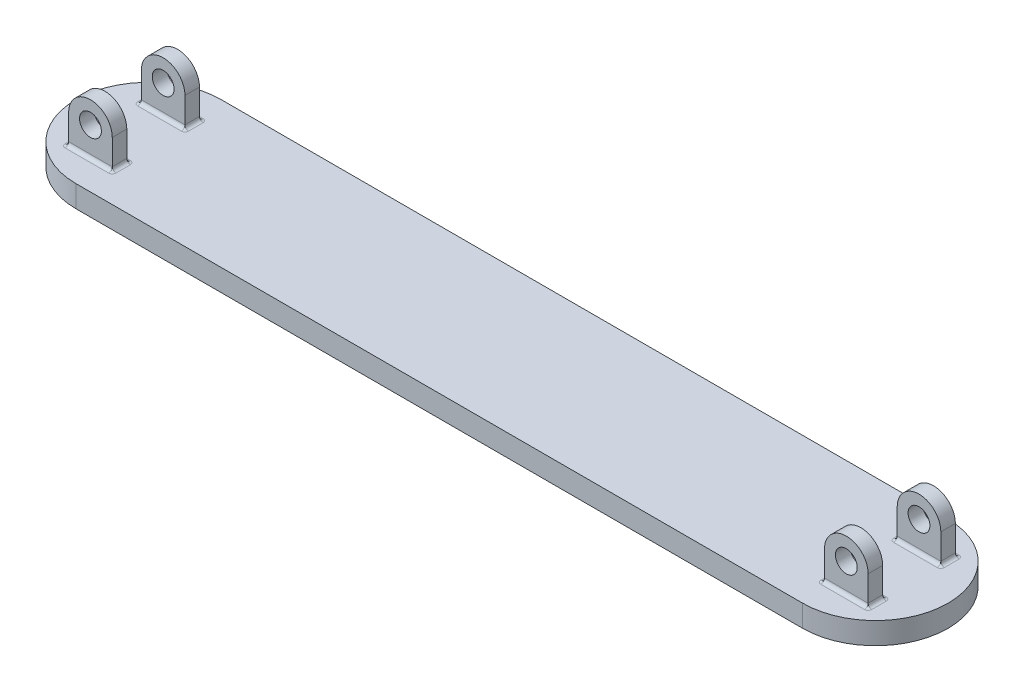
ISO-10303-21;
HEADER;
FILE_DESCRIPTION(('STEP AP214'),'2;1');
FILE_NAME('part.step','',(''),(''),'','','');
FILE_SCHEMA(('AUTOMOTIVE_DESIGN { 1 0 10303 214 1 1 1 1 }'));
ENDSEC;
DATA;
#1=APPLICATION_CONTEXT('core data for automotive mechanical design processes');
#2=APPLICATION_PROTOCOL_DEFINITION('international standard','automotive_design',2000,#1);
#3=PRODUCT_CONTEXT('',#1,'mechanical');
#4=PRODUCT('Part','Part','',(#3));
#5=PRODUCT_RELATED_PRODUCT_CATEGORY('part','',(#4));
#6=PRODUCT_DEFINITION_FORMATION('','',#4);
#7=PRODUCT_DEFINITION_CONTEXT('part definition',#1,'design');
#8=PRODUCT_DEFINITION('design','',#6,#7);
#9=PRODUCT_DEFINITION_SHAPE('','',#8);
#10=(LENGTH_UNIT() NAMED_UNIT(*) SI_UNIT(.MILLI.,.METRE.));
#11=(NAMED_UNIT(*) PLANE_ANGLE_UNIT() SI_UNIT($,.RADIAN.));
#12=(NAMED_UNIT(*) SI_UNIT($,.STERADIAN.) SOLID_ANGLE_UNIT());
#13=UNCERTAINTY_MEASURE_WITH_UNIT(LENGTH_MEASURE(1.E-05),#10,'distance_accuracy_value','');
#14=(GEOMETRIC_REPRESENTATION_CONTEXT(3) GLOBAL_UNCERTAINTY_ASSIGNED_CONTEXT((#13)) GLOBAL_UNIT_ASSIGNED_CONTEXT((#10,
#11,#12)) REPRESENTATION_CONTEXT('',''));
#15=CARTESIAN_POINT('',(0.,0.,0.));
#16=DIRECTION('',(0.,0.,1.));
#17=DIRECTION('',(1.,0.,0.));
#18=AXIS2_PLACEMENT_3D('',#15,#16,#17);
#19=CARTESIAN_POINT('',(-50.,3.,0.));
#20=DIRECTION('',(0.,-1.,0.));
#21=DIRECTION('',(0.,0.,-1.));
#22=AXIS2_PLACEMENT_3D('',#19,#20,#21);
#23=CYLINDRICAL_SURFACE('',#22,10.);
#24=DIRECTION('',(0.,-1.,0.));
#25=VECTOR('',#24,1.);
#26=CARTESIAN_POINT('',(-50.,3.,10.));
#27=LINE('',#26,#25);
#28=CARTESIAN_POINT('',(-50.,3.,10.));
#29=VERTEX_POINT('',#28);
#30=CARTESIAN_POINT('',(-50.,0.,10.));
#31=VERTEX_POINT('',#30);
#32=EDGE_CURVE('E534',#29,#31,#27,.T.);
#33=ORIENTED_EDGE('',*,*,#32,.F.);
#34=CARTESIAN_POINT('',(-50.,3.,0.));
#35=DIRECTION('',(0.,1.,0.));
#36=DIRECTION('',(0.,0.,1.));
#37=AXIS2_PLACEMENT_3D('',#34,#35,#36);
#38=CIRCLE('',#37,10.);
#39=CARTESIAN_POINT('',(-50.,3.,-10.));
#40=VERTEX_POINT('',#39);
#41=EDGE_CURVE('E40',#40,#29,#38,.T.);
#42=ORIENTED_EDGE('',*,*,#41,.F.);
#43=DIRECTION('',(0.,-1.,0.));
#44=VECTOR('',#43,1.);
#45=CARTESIAN_POINT('',(-50.,3.,-10.));
#46=LINE('',#45,#44);
#47=CARTESIAN_POINT('',(-50.,0.,-10.));
#48=VERTEX_POINT('',#47);
#49=EDGE_CURVE('E537',#48,#40,#46,.F.);
#50=ORIENTED_EDGE('',*,*,#49,.F.);
#51=CARTESIAN_POINT('',(-50.,0.,0.));
#52=DIRECTION('',(0.,1.,0.));
#53=DIRECTION('',(0.,0.,1.));
#54=AXIS2_PLACEMENT_3D('',#51,#52,#53);
#55=CIRCLE('',#54,10.);
#56=EDGE_CURVE('E11',#31,#48,#55,.F.);
#57=ORIENTED_EDGE('',*,*,#56,.F.);
#58=EDGE_LOOP('',(#33,#42,#50,#57));
#59=FACE_BOUND('',#58,.T.);
#60=ADVANCED_FACE('F33',(#59),#23,.T.);
#61=CARTESIAN_POINT('',(50.,3.,0.));
#62=DIRECTION('',(0.,-1.,0.));
#63=DIRECTION('',(0.,0.,-1.));
#64=AXIS2_PLACEMENT_3D('',#61,#62,#63);
#65=CYLINDRICAL_SURFACE('',#64,10.);
#66=DIRECTION('',(0.,-1.,0.));
#67=VECTOR('',#66,1.);
#68=CARTESIAN_POINT('',(50.,3.,-10.));
#69=LINE('',#68,#67);
#70=CARTESIAN_POINT('',(50.,3.,-10.));
#71=VERTEX_POINT('',#70);
#72=CARTESIAN_POINT('',(50.,0.,-10.));
#73=VERTEX_POINT('',#72);
#74=EDGE_CURVE('E523',#71,#73,#69,.T.);
#75=ORIENTED_EDGE('',*,*,#74,.F.);
#76=CARTESIAN_POINT('',(50.,3.,0.));
#77=DIRECTION('',(0.,1.,0.));
#78=DIRECTION('',(0.,0.,1.));
#79=AXIS2_PLACEMENT_3D('',#76,#77,#78);
#80=CIRCLE('',#79,10.);
#81=CARTESIAN_POINT('',(50.,3.,10.));
#82=VERTEX_POINT('',#81);
#83=EDGE_CURVE('E529',#82,#71,#80,.T.);
#84=ORIENTED_EDGE('',*,*,#83,.F.);
#85=DIRECTION('',(0.,-1.,0.));
#86=VECTOR('',#85,1.);
#87=CARTESIAN_POINT('',(50.,3.,10.));
#88=LINE('',#87,#86);
#89=CARTESIAN_POINT('',(50.,0.,10.));
#90=VERTEX_POINT('',#89);
#91=EDGE_CURVE('E526',#90,#82,#88,.F.);
#92=ORIENTED_EDGE('',*,*,#91,.F.);
#93=CARTESIAN_POINT('',(50.,0.,0.));
#94=DIRECTION('',(0.,1.,0.));
#95=DIRECTION('',(0.,0.,1.));
#96=AXIS2_PLACEMENT_3D('',#93,#94,#95);
#97=CIRCLE('',#96,10.);
#98=EDGE_CURVE('E531',#73,#90,#97,.F.);
#99=ORIENTED_EDGE('',*,*,#98,.F.);
#100=EDGE_LOOP('',(#75,#84,#92,#99));
#101=FACE_BOUND('',#100,.T.);
#102=ADVANCED_FACE('F549',(#101),#65,.T.);
#103=CARTESIAN_POINT('',(-60.,3.,10.));
#104=DIRECTION('',(0.,1.,0.));
#105=DIRECTION('',(0.,0.,1.));
#106=AXIS2_PLACEMENT_3D('',#103,#104,#105);
#107=PLANE('',#106);
#108=DIRECTION('',(-1.,0.,0.));
#109=VECTOR('',#108,1.);
#110=CARTESIAN_POINT('',(-60.,3.,-10.));
#111=LINE('',#110,#109);
#112=EDGE_CURVE('E401',#71,#40,#111,.T.);
#113=ORIENTED_EDGE('',*,*,#112,.T.);
#114=ORIENTED_EDGE('',*,*,#41,.T.);
#115=DIRECTION('',(1.,0.,0.));
#116=VECTOR('',#115,1.);
#117=CARTESIAN_POINT('',(-60.,3.,10.));
#118=LINE('',#117,#116);
#119=EDGE_CURVE('E399',#29,#82,#118,.T.);
#120=ORIENTED_EDGE('',*,*,#119,.T.);
#121=ORIENTED_EDGE('',*,*,#83,.T.);
#122=EDGE_LOOP('',(#113,#114,#120,#121));
#123=FACE_BOUND('',#122,.T.);
#124=CARTESIAN_POINT('',(-55.,3.,6.));
#125=DIRECTION('',(0.,1.,0.));
#126=DIRECTION('',(0.,0.,1.));
#127=AXIS2_PLACEMENT_3D('',#124,#125,#126);
#128=CIRCLE('',#127,0.5);
#129=CARTESIAN_POINT('',(-55.5,3.,6.));
#130=VERTEX_POINT('',#129);
#131=CARTESIAN_POINT('',(-55.,3.,6.5));
#132=VERTEX_POINT('',#131);
#133=EDGE_CURVE('E407',#130,#132,#128,.T.);
#134=ORIENTED_EDGE('',*,*,#133,.F.);
#135=DIRECTION('',(0.,0.,-1.));
#136=VECTOR('',#135,1.);
#137=CARTESIAN_POINT('',(-55.5,3.,10.));
#138=LINE('',#137,#136);
#139=CARTESIAN_POINT('',(-55.5,3.,4.));
#140=VERTEX_POINT('',#139);
#141=EDGE_CURVE('E425',#130,#140,#138,.T.);
#142=ORIENTED_EDGE('',*,*,#141,.T.);
#143=CARTESIAN_POINT('',(-55.,3.,4.));
#144=DIRECTION('',(0.,1.,0.));
#145=DIRECTION('',(0.,0.,1.));
#146=AXIS2_PLACEMENT_3D('',#143,#144,#145);
#147=CIRCLE('',#146,0.5);
#148=CARTESIAN_POINT('',(-55.,3.,3.5));
#149=VERTEX_POINT('',#148);
#150=EDGE_CURVE('E422',#149,#140,#147,.T.);
#151=ORIENTED_EDGE('',*,*,#150,.F.);
#152=DIRECTION('',(1.,0.,0.));
#153=VECTOR('',#152,1.);
#154=CARTESIAN_POINT('',(-49.,3.,3.5));
#155=LINE('',#154,#153);
#156=CARTESIAN_POINT('',(-49.,3.,3.5));
#157=VERTEX_POINT('',#156);
#158=EDGE_CURVE('E420',#149,#157,#155,.T.);
#159=ORIENTED_EDGE('',*,*,#158,.T.);
#160=CARTESIAN_POINT('',(-49.,3.,4.));
#161=DIRECTION('',(0.,1.,0.));
#162=DIRECTION('',(0.,0.,1.));
#163=AXIS2_PLACEMENT_3D('',#160,#161,#162);
#164=CIRCLE('',#163,0.5);
#165=CARTESIAN_POINT('',(-48.5,3.,4.));
#166=VERTEX_POINT('',#165);
#167=EDGE_CURVE('E417',#166,#157,#164,.T.);
#168=ORIENTED_EDGE('',*,*,#167,.F.);
#169=DIRECTION('',(0.,0.,-1.));
#170=VECTOR('',#169,1.);
#171=CARTESIAN_POINT('',(-48.5,3.,10.));
#172=LINE('',#171,#170);
#173=CARTESIAN_POINT('',(-48.5,3.,6.));
#174=VERTEX_POINT('',#173);
#175=EDGE_CURVE('E415',#166,#174,#172,.F.);
#176=ORIENTED_EDGE('',*,*,#175,.T.);
#177=CARTESIAN_POINT('',(-49.,3.,6.));
#178=DIRECTION('',(0.,1.,0.));
#179=DIRECTION('',(0.,0.,1.));
#180=AXIS2_PLACEMENT_3D('',#177,#178,#179);
#181=CIRCLE('',#180,0.5);
#182=CARTESIAN_POINT('',(-49.,3.,6.5));
#183=VERTEX_POINT('',#182);
#184=EDGE_CURVE('E412',#183,#174,#181,.T.);
#185=ORIENTED_EDGE('',*,*,#184,.F.);
#186=DIRECTION('',(1.,0.,0.));
#187=VECTOR('',#186,1.);
#188=CARTESIAN_POINT('',(-60.,3.,6.5));
#189=LINE('',#188,#187);
#190=EDGE_CURVE('E410',#183,#132,#189,.F.);
#191=ORIENTED_EDGE('',*,*,#190,.T.);
#192=EDGE_LOOP('',(#134,#142,#151,#159,#168,#176,#185,#191));
#193=FACE_BOUND('',#192,.T.);
#194=CARTESIAN_POINT('',(-49.,3.,-6.));
#195=DIRECTION('',(0.,1.,0.));
#196=DIRECTION('',(0.,0.,1.));
#197=AXIS2_PLACEMENT_3D('',#194,#195,#196);
#198=CIRCLE('',#197,0.5);
#199=CARTESIAN_POINT('',(-48.5,3.,-6.));
#200=VERTEX_POINT('',#199);
#201=CARTESIAN_POINT('',(-49.,3.,-6.5));
#202=VERTEX_POINT('',#201);
#203=EDGE_CURVE('E446',#200,#202,#198,.T.);
#204=ORIENTED_EDGE('',*,*,#203,.F.);
#205=DIRECTION('',(0.,0.,-1.));
#206=VECTOR('',#205,1.);
#207=CARTESIAN_POINT('',(-48.5,3.,10.));
#208=LINE('',#207,#206);
#209=CARTESIAN_POINT('',(-48.5,3.,-4.));
#210=VERTEX_POINT('',#209);
#211=EDGE_CURVE('E443',#200,#210,#208,.F.);
#212=ORIENTED_EDGE('',*,*,#211,.T.);
#213=CARTESIAN_POINT('',(-49.,3.,-4.));
#214=DIRECTION('',(0.,1.,0.));
#215=DIRECTION('',(0.,0.,1.));
#216=AXIS2_PLACEMENT_3D('',#213,#214,#215);
#217=CIRCLE('',#216,0.5);
#218=CARTESIAN_POINT('',(-49.,3.,-3.5));
#219=VERTEX_POINT('',#218);
#220=EDGE_CURVE('E440',#219,#210,#217,.T.);
#221=ORIENTED_EDGE('',*,*,#220,.F.);
#222=DIRECTION('',(-1.,0.,0.));
#223=VECTOR('',#222,1.);
#224=CARTESIAN_POINT('',(-55.,3.,-3.5));
#225=LINE('',#224,#223);
#226=CARTESIAN_POINT('',(-55.,3.,-3.5));
#227=VERTEX_POINT('',#226);
#228=EDGE_CURVE('E438',#219,#227,#225,.T.);
#229=ORIENTED_EDGE('',*,*,#228,.T.);
#230=CARTESIAN_POINT('',(-55.,3.,-4.));
#231=DIRECTION('',(0.,1.,0.));
#232=DIRECTION('',(0.,0.,1.));
#233=AXIS2_PLACEMENT_3D('',#230,#231,#232);
#234=CIRCLE('',#233,0.5);
#235=CARTESIAN_POINT('',(-55.5,3.,-4.));
#236=VERTEX_POINT('',#235);
#237=EDGE_CURVE('E435',#236,#227,#234,.T.);
#238=ORIENTED_EDGE('',*,*,#237,.F.);
#239=DIRECTION('',(0.,0.,-1.));
#240=VECTOR('',#239,1.);
#241=CARTESIAN_POINT('',(-55.5,3.,10.));
#242=LINE('',#241,#240);
#243=CARTESIAN_POINT('',(-55.5,3.,-6.));
#244=VERTEX_POINT('',#243);
#245=EDGE_CURVE('E431',#236,#244,#242,.T.);
#246=ORIENTED_EDGE('',*,*,#245,.T.);
#247=CARTESIAN_POINT('',(-55.,3.,-6.));
#248=DIRECTION('',(0.,1.,0.));
#249=DIRECTION('',(0.,0.,1.));
#250=AXIS2_PLACEMENT_3D('',#247,#248,#249);
#251=CIRCLE('',#250,0.5);
#252=CARTESIAN_POINT('',(-55.,3.,-6.5));
#253=VERTEX_POINT('',#252);
#254=EDGE_CURVE('E428',#253,#244,#251,.T.);
#255=ORIENTED_EDGE('',*,*,#254,.F.);
#256=DIRECTION('',(1.,0.,0.));
#257=VECTOR('',#256,1.);
#258=CARTESIAN_POINT('',(-49.,3.,-6.5));
#259=LINE('',#258,#257);
#260=EDGE_CURVE('E433',#253,#202,#259,.T.);
#261=ORIENTED_EDGE('',*,*,#260,.T.);
#262=EDGE_LOOP('',(#204,#212,#221,#229,#238,#246,#255,#261));
#263=FACE_BOUND('',#262,.T.);
#264=CARTESIAN_POINT('',(49.,3.,4.));
#265=DIRECTION('',(0.,1.,0.));
#266=DIRECTION('',(0.,0.,1.));
#267=AXIS2_PLACEMENT_3D('',#264,#265,#266);
#268=CIRCLE('',#267,0.5);
#269=CARTESIAN_POINT('',(49.,3.,3.5));
#270=VERTEX_POINT('',#269);
#271=CARTESIAN_POINT('',(48.5,3.,4.));
#272=VERTEX_POINT('',#271);
#273=EDGE_CURVE('E477',#270,#272,#268,.T.);
#274=ORIENTED_EDGE('',*,*,#273,.F.);
#275=DIRECTION('',(-1.,0.,0.));
#276=VECTOR('',#275,1.);
#277=CARTESIAN_POINT('',(-60.,3.,3.49999999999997));
#278=LINE('',#277,#276);
#279=CARTESIAN_POINT('',(55.,3.,3.5));
#280=VERTEX_POINT('',#279);
#281=EDGE_CURVE('E483',#270,#280,#278,.F.);
#282=ORIENTED_EDGE('',*,*,#281,.T.);
#283=CARTESIAN_POINT('',(55.,3.,4.));
#284=DIRECTION('',(0.,1.,0.));
#285=DIRECTION('',(0.,0.,1.));
#286=AXIS2_PLACEMENT_3D('',#283,#284,#285);
#287=CIRCLE('',#286,0.5);
#288=CARTESIAN_POINT('',(55.5,3.,4.));
#289=VERTEX_POINT('',#288);
#290=EDGE_CURVE('E480',#289,#280,#287,.T.);
#291=ORIENTED_EDGE('',*,*,#290,.F.);
#292=DIRECTION('',(0.,0.,-1.));
#293=VECTOR('',#292,1.);
#294=CARTESIAN_POINT('',(55.5,3.,6.));
#295=LINE('',#294,#293);
#296=CARTESIAN_POINT('',(55.5,3.,6.));
#297=VERTEX_POINT('',#296);
#298=EDGE_CURVE('E474',#289,#297,#295,.F.);
#299=ORIENTED_EDGE('',*,*,#298,.T.);
#300=CARTESIAN_POINT('',(55.,3.,6.));
#301=DIRECTION('',(0.,1.,0.));
#302=DIRECTION('',(0.,0.,1.));
#303=AXIS2_PLACEMENT_3D('',#300,#301,#302);
#304=CIRCLE('',#303,0.5);
#305=CARTESIAN_POINT('',(55.,3.,6.5));
#306=VERTEX_POINT('',#305);
#307=EDGE_CURVE('E471',#306,#297,#304,.T.);
#308=ORIENTED_EDGE('',*,*,#307,.F.);
#309=DIRECTION('',(-1.,0.,0.));
#310=VECTOR('',#309,1.);
#311=CARTESIAN_POINT('',(-60.,3.,6.5));
#312=LINE('',#311,#310);
#313=CARTESIAN_POINT('',(49.,3.,6.5));
#314=VERTEX_POINT('',#313);
#315=EDGE_CURVE('E467',#306,#314,#312,.T.);
#316=ORIENTED_EDGE('',*,*,#315,.T.);
#317=CARTESIAN_POINT('',(49.,3.,6.));
#318=DIRECTION('',(0.,1.,0.));
#319=DIRECTION('',(0.,0.,1.));
#320=AXIS2_PLACEMENT_3D('',#317,#318,#319);
#321=CIRCLE('',#320,0.5);
#322=CARTESIAN_POINT('',(48.5,3.,6.));
#323=VERTEX_POINT('',#322);
#324=EDGE_CURVE('E464',#323,#314,#321,.T.);
#325=ORIENTED_EDGE('',*,*,#324,.F.);
#326=DIRECTION('',(0.,0.,-1.));
#327=VECTOR('',#326,1.);
#328=CARTESIAN_POINT('',(48.5,3.,4.));
#329=LINE('',#328,#327);
#330=EDGE_CURVE('E469',#323,#272,#329,.T.);
#331=ORIENTED_EDGE('',*,*,#330,.T.);
#332=EDGE_LOOP('',(#274,#282,#291,#299,#308,#316,#325,#331));
#333=FACE_BOUND('',#332,.T.);
#334=CARTESIAN_POINT('',(49.,3.,-4.));
#335=DIRECTION('',(0.,1.,0.));
#336=DIRECTION('',(0.,0.,1.));
#337=AXIS2_PLACEMENT_3D('',#334,#335,#336);
#338=CIRCLE('',#337,0.5);
#339=CARTESIAN_POINT('',(48.5,3.,-4.));
#340=VERTEX_POINT('',#339);
#341=CARTESIAN_POINT('',(49.,3.,-3.5));
#342=VERTEX_POINT('',#341);
#343=EDGE_CURVE('E503',#340,#342,#338,.T.);
#344=ORIENTED_EDGE('',*,*,#343,.F.);
#345=DIRECTION('',(0.,0.,-1.));
#346=VECTOR('',#345,1.);
#347=CARTESIAN_POINT('',(48.5,3.,-6.));
#348=LINE('',#347,#346);
#349=CARTESIAN_POINT('',(48.5,3.,-6.));
#350=VERTEX_POINT('',#349);
#351=EDGE_CURVE('E500',#340,#350,#348,.T.);
#352=ORIENTED_EDGE('',*,*,#351,.T.);
#353=CARTESIAN_POINT('',(49.,3.,-6.));
#354=DIRECTION('',(0.,1.,0.));
#355=DIRECTION('',(0.,0.,1.));
#356=AXIS2_PLACEMENT_3D('',#353,#354,#355);
#357=CIRCLE('',#356,0.5);
#358=CARTESIAN_POINT('',(49.,3.,-6.5));
#359=VERTEX_POINT('',#358);
#360=EDGE_CURVE('E497',#359,#350,#357,.T.);
#361=ORIENTED_EDGE('',*,*,#360,.F.);
#362=DIRECTION('',(-1.,0.,0.));
#363=VECTOR('',#362,1.);
#364=CARTESIAN_POINT('',(55.,3.,-6.5));
#365=LINE('',#364,#363);
#366=CARTESIAN_POINT('',(55.,3.,-6.5));
#367=VERTEX_POINT('',#366);
#368=EDGE_CURVE('E493',#359,#367,#365,.F.);
#369=ORIENTED_EDGE('',*,*,#368,.T.);
#370=CARTESIAN_POINT('',(55.,3.,-6.));
#371=DIRECTION('',(0.,1.,0.));
#372=DIRECTION('',(0.,0.,1.));
#373=AXIS2_PLACEMENT_3D('',#370,#371,#372);
#374=CIRCLE('',#373,0.5);
#375=CARTESIAN_POINT('',(55.5,3.,-6.));
#376=VERTEX_POINT('',#375);
#377=EDGE_CURVE('E490',#376,#367,#374,.T.);
#378=ORIENTED_EDGE('',*,*,#377,.F.);
#379=DIRECTION('',(0.,0.,-1.));
#380=VECTOR('',#379,1.);
#381=CARTESIAN_POINT('',(55.5,3.,-4.));
#382=LINE('',#381,#380);
#383=CARTESIAN_POINT('',(55.5,3.,-4.));
#384=VERTEX_POINT('',#383);
#385=EDGE_CURVE('E488',#376,#384,#382,.F.);
#386=ORIENTED_EDGE('',*,*,#385,.T.);
#387=CARTESIAN_POINT('',(55.,3.,-4.));
#388=DIRECTION('',(0.,1.,0.));
#389=DIRECTION('',(0.,0.,1.));
#390=AXIS2_PLACEMENT_3D('',#387,#388,#389);
#391=CIRCLE('',#390,0.5);
#392=CARTESIAN_POINT('',(55.,3.,-3.5));
#393=VERTEX_POINT('',#392);
#394=EDGE_CURVE('E485',#393,#384,#391,.T.);
#395=ORIENTED_EDGE('',*,*,#394,.F.);
#396=DIRECTION('',(1.,0.,0.));
#397=VECTOR('',#396,1.);
#398=CARTESIAN_POINT('',(-60.,3.,-3.5));
#399=LINE('',#398,#397);
#400=EDGE_CURVE('E495',#393,#342,#399,.F.);
#401=ORIENTED_EDGE('',*,*,#400,.T.);
#402=EDGE_LOOP('',(#344,#352,#361,#369,#378,#386,#395,#401));
#403=FACE_BOUND('',#402,.T.);
#404=ADVANCED_FACE('F539',(#123,#193,#263,#333,#403),#107,.T.);
#405=CARTESIAN_POINT('',(55.,3.,6.));
#406=DIRECTION('',(1.,0.,0.));
#407=DIRECTION('',(0.,1.,0.));
#408=AXIS2_PLACEMENT_3D('',#405,#406,#407);
#409=PLANE('',#408);
#410=DIRECTION('',(0.,-1.,0.));
#411=VECTOR('',#410,1.);
#412=CARTESIAN_POINT('',(55.,3.,6.));
#413=LINE('',#412,#411);
#414=CARTESIAN_POINT('',(55.,7.,6.));
#415=VERTEX_POINT('',#414);
#416=CARTESIAN_POINT('',(55.,3.5,6.));
#417=VERTEX_POINT('',#416);
#418=EDGE_CURVE('E896',#415,#417,#413,.T.);
#419=ORIENTED_EDGE('',*,*,#418,.T.);
#420=DIRECTION('',(0.,0.,-1.));
#421=VECTOR('',#420,1.);
#422=CARTESIAN_POINT('',(55.,3.5,4.));
#423=LINE('',#422,#421);
#424=CARTESIAN_POINT('',(55.,3.5,4.));
#425=VERTEX_POINT('',#424);
#426=EDGE_CURVE('E515',#417,#425,#423,.T.);
#427=ORIENTED_EDGE('',*,*,#426,.T.);
#428=DIRECTION('',(0.,-1.,0.));
#429=VECTOR('',#428,1.);
#430=CARTESIAN_POINT('',(55.,10.001,4.));
#431=LINE('',#430,#429);
#432=CARTESIAN_POINT('',(55.,7.,4.));
#433=VERTEX_POINT('',#432);
#434=EDGE_CURVE('E879',#433,#425,#431,.T.);
#435=ORIENTED_EDGE('',*,*,#434,.F.);
#436=DIRECTION('',(0.,0.,-1.));
#437=VECTOR('',#436,1.);
#438=CARTESIAN_POINT('',(55.,7.,6.));
#439=LINE('',#438,#437);
#440=EDGE_CURVE('E283',#415,#433,#439,.T.);
#441=ORIENTED_EDGE('',*,*,#440,.F.);
#442=EDGE_LOOP('',(#419,#427,#435,#441));
#443=FACE_BOUND('',#442,.T.);
#444=ADVANCED_FACE('F573',(#443),#409,.T.);
#445=CARTESIAN_POINT('',(52.,7.,6.));
#446=DIRECTION('',(0.,0.,-1.));
#447=DIRECTION('',(-1.,0.,0.));
#448=AXIS2_PLACEMENT_3D('',#445,#446,#447);
#449=CYLINDRICAL_SURFACE('',#448,2.99999999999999);
#450=CARTESIAN_POINT('',(52.,7.,4.));
#451=DIRECTION('',(0.,0.,1.));
#452=DIRECTION('',(1.,0.,0.));
#453=AXIS2_PLACEMENT_3D('',#450,#451,#452);
#454=CIRCLE('',#453,2.99999999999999);
#455=CARTESIAN_POINT('',(49.,7.,4.));
#456=VERTEX_POINT('',#455);
#457=EDGE_CURVE('E267',#433,#456,#454,.T.);
#458=ORIENTED_EDGE('',*,*,#457,.T.);
#459=DIRECTION('',(0.,0.,-1.));
#460=VECTOR('',#459,1.);
#461=CARTESIAN_POINT('',(49.,7.,6.));
#462=LINE('',#461,#460);
#463=CARTESIAN_POINT('',(49.,7.,6.));
#464=VERTEX_POINT('',#463);
#465=EDGE_CURVE('E281',#464,#456,#462,.T.);
#466=ORIENTED_EDGE('',*,*,#465,.F.);
#467=CARTESIAN_POINT('',(52.,7.,6.));
#468=DIRECTION('',(0.,0.,-1.));
#469=DIRECTION('',(1.,0.,0.));
#470=AXIS2_PLACEMENT_3D('',#467,#468,#469);
#471=CIRCLE('',#470,2.99999999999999);
#472=EDGE_CURVE('E898',#464,#415,#471,.T.);
#473=ORIENTED_EDGE('',*,*,#472,.T.);
#474=ORIENTED_EDGE('',*,*,#440,.T.);
#475=EDGE_LOOP('',(#458,#466,#473,#474));
#476=FACE_BOUND('',#475,.T.);
#477=ADVANCED_FACE('F279',(#476),#449,.T.);
#478=CARTESIAN_POINT('',(49.,7.,6.));
#479=DIRECTION('',(-1.,0.,0.));
#480=DIRECTION('',(0.,-1.,0.));
#481=AXIS2_PLACEMENT_3D('',#478,#479,#480);
#482=PLANE('',#481);
#483=DIRECTION('',(0.,-1.,0.));
#484=VECTOR('',#483,1.);
#485=CARTESIAN_POINT('',(49.,10.001,4.));
#486=LINE('',#485,#484);
#487=CARTESIAN_POINT('',(49.,3.5,4.));
#488=VERTEX_POINT('',#487);
#489=EDGE_CURVE('E262',#456,#488,#486,.T.);
#490=ORIENTED_EDGE('',*,*,#489,.T.);
#491=DIRECTION('',(0.,0.,-1.));
#492=VECTOR('',#491,1.);
#493=CARTESIAN_POINT('',(49.,3.5,6.));
#494=LINE('',#493,#492);
#495=CARTESIAN_POINT('',(49.,3.5,6.));
#496=VERTEX_POINT('',#495);
#497=EDGE_CURVE('E519',#488,#496,#494,.F.);
#498=ORIENTED_EDGE('',*,*,#497,.T.);
#499=DIRECTION('',(0.,1.,0.));
#500=VECTOR('',#499,1.);
#501=CARTESIAN_POINT('',(49.,7.,6.));
#502=LINE('',#501,#500);
#503=EDGE_CURVE('E288',#496,#464,#502,.T.);
#504=ORIENTED_EDGE('',*,*,#503,.T.);
#505=ORIENTED_EDGE('',*,*,#465,.T.);
#506=EDGE_LOOP('',(#490,#498,#504,#505));
#507=FACE_BOUND('',#506,.T.);
#508=ADVANCED_FACE('F286',(#507),#482,.T.);
#509=CARTESIAN_POINT('',(52.,7.,6.));
#510=DIRECTION('',(0.,0.,-1.));
#511=DIRECTION('',(-1.,0.,0.));
#512=AXIS2_PLACEMENT_3D('',#509,#510,#511);
#513=CYLINDRICAL_SURFACE('',#512,1.5);
#514=CARTESIAN_POINT('',(52.,7.,4.));
#515=DIRECTION('',(0.,0.,1.));
#516=DIRECTION('',(1.,0.,0.));
#517=AXIS2_PLACEMENT_3D('',#514,#515,#516);
#518=CIRCLE('',#517,1.5);
#519=CARTESIAN_POINT('',(53.5,7.,4.));
#520=VERTEX_POINT('',#519);
#521=EDGE_CURVE('E869',#520,#520,#518,.T.);
#522=ORIENTED_EDGE('',*,*,#521,.F.);
#523=EDGE_LOOP('',(#522));
#524=FACE_BOUND('',#523,.T.);
#525=CARTESIAN_POINT('',(52.,7.,6.));
#526=DIRECTION('',(0.,0.,-1.));
#527=DIRECTION('',(-1.,0.,0.));
#528=AXIS2_PLACEMENT_3D('',#525,#526,#527);
#529=CIRCLE('',#528,1.5);
#530=CARTESIAN_POINT('',(50.5,7.,6.));
#531=VERTEX_POINT('',#530);
#532=EDGE_CURVE('E885',#531,#531,#529,.T.);
#533=ORIENTED_EDGE('',*,*,#532,.F.);
#534=EDGE_LOOP('',(#533));
#535=FACE_BOUND('',#534,.T.);
#536=ADVANCED_FACE('F608',(#524,#535),#513,.F.);
#537=CARTESIAN_POINT('',(-49.,7.,6.));
#538=DIRECTION('',(-1.,0.,0.));
#539=DIRECTION('',(0.,-1.,0.));
#540=AXIS2_PLACEMENT_3D('',#537,#538,#539);
#541=PLANE('',#540);
#542=DIRECTION('',(0.,1.,0.));
#543=VECTOR('',#542,1.);
#544=CARTESIAN_POINT('',(-49.,7.,6.));
#545=LINE('',#544,#543);
#546=CARTESIAN_POINT('',(-49.,3.5,6.));
#547=VERTEX_POINT('',#546);
#548=CARTESIAN_POINT('',(-49.,7.,6.));
#549=VERTEX_POINT('',#548);
#550=EDGE_CURVE('E379',#547,#549,#545,.T.);
#551=ORIENTED_EDGE('',*,*,#550,.F.);
#552=DIRECTION('',(0.,0.,-1.));
#553=VECTOR('',#552,1.);
#554=CARTESIAN_POINT('',(-49.,3.5,6.));
#555=LINE('',#554,#553);
#556=CARTESIAN_POINT('',(-49.,3.5,4.));
#557=VERTEX_POINT('',#556);
#558=EDGE_CURVE('E460',#547,#557,#555,.T.);
#559=ORIENTED_EDGE('',*,*,#558,.T.);
#560=DIRECTION('',(0.,-1.,0.));
#561=VECTOR('',#560,1.);
#562=CARTESIAN_POINT('',(-49.,10.001,4.));
#563=LINE('',#562,#561);
#564=CARTESIAN_POINT('',(-49.,7.,4.));
#565=VERTEX_POINT('',#564);
#566=EDGE_CURVE('E361',#565,#557,#563,.T.);
#567=ORIENTED_EDGE('',*,*,#566,.F.);
#568=DIRECTION('',(0.,0.,-1.));
#569=VECTOR('',#568,1.);
#570=CARTESIAN_POINT('',(-49.,7.,6.));
#571=LINE('',#570,#569);
#572=EDGE_CURVE('E391',#549,#565,#571,.T.);
#573=ORIENTED_EDGE('',*,*,#572,.F.);
#574=EDGE_LOOP('',(#551,#559,#567,#573));
#575=FACE_BOUND('',#574,.T.);
#576=ADVANCED_FACE('F606',(#575),#541,.F.);
#577=DIRECTION('',(0.,-1.,0.));
#578=VECTOR('',#577,1.);
#579=CARTESIAN_POINT('',(-49.,10.001,-4.));
#580=LINE('',#579,#578);
#581=CARTESIAN_POINT('',(-49.,7.,-4.));
#582=VERTEX_POINT('',#581);
#583=CARTESIAN_POINT('',(-49.,3.5,-4.));
#584=VERTEX_POINT('',#583);
#585=EDGE_CURVE('E358',#582,#584,#580,.T.);
#586=ORIENTED_EDGE('',*,*,#585,.T.);
#587=DIRECTION('',(0.,0.,-1.));
#588=VECTOR('',#587,1.);
#589=CARTESIAN_POINT('',(-49.,3.5,6.));
#590=LINE('',#589,#588);
#591=CARTESIAN_POINT('',(-49.,3.5,-6.));
#592=VERTEX_POINT('',#591);
#593=EDGE_CURVE('E404',#584,#592,#590,.T.);
#594=ORIENTED_EDGE('',*,*,#593,.T.);
#595=DIRECTION('',(0.,1.,0.));
#596=VECTOR('',#595,1.);
#597=CARTESIAN_POINT('',(-49.,7.,-6.));
#598=LINE('',#597,#596);
#599=CARTESIAN_POINT('',(-49.,7.,-6.));
#600=VERTEX_POINT('',#599);
#601=EDGE_CURVE('E371',#592,#600,#598,.T.);
#602=ORIENTED_EDGE('',*,*,#601,.T.);
#603=EDGE_CURVE('E390',#582,#600,#571,.T.);
#604=ORIENTED_EDGE('',*,*,#603,.F.);
#605=EDGE_LOOP('',(#586,#594,#602,#604));
#606=FACE_BOUND('',#605,.T.);
#607=ADVANCED_FACE('F604',(#606),#541,.F.);
#608=CARTESIAN_POINT('',(-52.,7.,6.));
#609=DIRECTION('',(0.,0.,-1.));
#610=DIRECTION('',(-1.,0.,0.));
#611=AXIS2_PLACEMENT_3D('',#608,#609,#610);
#612=CYLINDRICAL_SURFACE('',#611,2.99999999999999);
#613=CARTESIAN_POINT('',(-52.,7.,4.));
#614=DIRECTION('',(0.,0.,-1.));
#615=DIRECTION('',(-1.,0.,0.));
#616=AXIS2_PLACEMENT_3D('',#613,#614,#615);
#617=CIRCLE('',#616,2.99999999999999);
#618=CARTESIAN_POINT('',(-55.,7.,4.));
#619=VERTEX_POINT('',#618);
#620=EDGE_CURVE('E344',#565,#619,#617,.F.);
#621=ORIENTED_EDGE('',*,*,#620,.T.);
#622=DIRECTION('',(0.,0.,-1.));
#623=VECTOR('',#622,1.);
#624=CARTESIAN_POINT('',(-55.,7.,6.));
#625=LINE('',#624,#623);
#626=CARTESIAN_POINT('',(-55.,7.,6.));
#627=VERTEX_POINT('',#626);
#628=EDGE_CURVE('E387',#627,#619,#625,.T.);
#629=ORIENTED_EDGE('',*,*,#628,.F.);
#630=CARTESIAN_POINT('',(-52.,7.,6.));
#631=DIRECTION('',(0.,0.,1.));
#632=DIRECTION('',(-1.,0.,0.));
#633=AXIS2_PLACEMENT_3D('',#630,#631,#632);
#634=CIRCLE('',#633,2.99999999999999);
#635=EDGE_CURVE('E381',#549,#627,#634,.T.);
#636=ORIENTED_EDGE('',*,*,#635,.F.);
#637=ORIENTED_EDGE('',*,*,#572,.T.);
#638=EDGE_LOOP('',(#621,#629,#636,#637));
#639=FACE_BOUND('',#638,.T.);
#640=ADVANCED_FACE('F602',(#639),#612,.T.);
#641=CARTESIAN_POINT('',(-52.,7.,-4.));
#642=DIRECTION('',(0.,0.,1.));
#643=DIRECTION('',(1.,0.,0.));
#644=AXIS2_PLACEMENT_3D('',#641,#642,#643);
#645=CIRCLE('',#644,2.99999999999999);
#646=CARTESIAN_POINT('',(-55.,7.,-4.));
#647=VERTEX_POINT('',#646);
#648=EDGE_CURVE('E341',#647,#582,#645,.F.);
#649=ORIENTED_EDGE('',*,*,#648,.T.);
#650=ORIENTED_EDGE('',*,*,#603,.T.);
#651=CARTESIAN_POINT('',(-52.,7.,-6.));
#652=DIRECTION('',(0.,0.,1.));
#653=DIRECTION('',(-1.,0.,0.));
#654=AXIS2_PLACEMENT_3D('',#651,#652,#653);
#655=CIRCLE('',#654,2.99999999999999);
#656=CARTESIAN_POINT('',(-55.,7.,-6.));
#657=VERTEX_POINT('',#656);
#658=EDGE_CURVE('E373',#600,#657,#655,.T.);
#659=ORIENTED_EDGE('',*,*,#658,.T.);
#660=EDGE_CURVE('E386',#647,#657,#625,.T.);
#661=ORIENTED_EDGE('',*,*,#660,.F.);
#662=EDGE_LOOP('',(#649,#650,#659,#661));
#663=FACE_BOUND('',#662,.T.);
#664=ADVANCED_FACE('F600',(#663),#612,.T.);
#665=CARTESIAN_POINT('',(-55.,3.,6.));
#666=DIRECTION('',(1.,0.,0.));
#667=DIRECTION('',(0.,1.,0.));
#668=AXIS2_PLACEMENT_3D('',#665,#666,#667);
#669=PLANE('',#668);
#670=DIRECTION('',(0.,-1.,0.));
#671=VECTOR('',#670,1.);
#672=CARTESIAN_POINT('',(-55.,10.001,4.));
#673=LINE('',#672,#671);
#674=CARTESIAN_POINT('',(-55.,3.5,4.));
#675=VERTEX_POINT('',#674);
#676=EDGE_CURVE('E347',#619,#675,#673,.T.);
#677=ORIENTED_EDGE('',*,*,#676,.T.);
#678=DIRECTION('',(0.,0.,-1.));
#679=VECTOR('',#678,1.);
#680=CARTESIAN_POINT('',(-55.,3.5,6.));
#681=LINE('',#680,#679);
#682=CARTESIAN_POINT('',(-55.,3.5,6.));
#683=VERTEX_POINT('',#682);
#684=EDGE_CURVE('E455',#675,#683,#681,.F.);
#685=ORIENTED_EDGE('',*,*,#684,.T.);
#686=DIRECTION('',(0.,-1.,0.));
#687=VECTOR('',#686,1.);
#688=CARTESIAN_POINT('',(-55.,3.,6.));
#689=LINE('',#688,#687);
#690=EDGE_CURVE('E383',#627,#683,#689,.T.);
#691=ORIENTED_EDGE('',*,*,#690,.F.);
#692=ORIENTED_EDGE('',*,*,#628,.T.);
#693=EDGE_LOOP('',(#677,#685,#691,#692));
#694=FACE_BOUND('',#693,.T.);
#695=ADVANCED_FACE('F597',(#694),#669,.F.);
#696=DIRECTION('',(0.,-1.,0.));
#697=VECTOR('',#696,1.);
#698=CARTESIAN_POINT('',(-55.,3.,-6.));
#699=LINE('',#698,#697);
#700=CARTESIAN_POINT('',(-55.,3.5,-6.));
#701=VERTEX_POINT('',#700);
#702=EDGE_CURVE('E376',#657,#701,#699,.T.);
#703=ORIENTED_EDGE('',*,*,#702,.T.);
#704=DIRECTION('',(0.,0.,-1.));
#705=VECTOR('',#704,1.);
#706=CARTESIAN_POINT('',(-55.,3.5,6.));
#707=LINE('',#706,#705);
#708=CARTESIAN_POINT('',(-55.,3.5,-4.));
#709=VERTEX_POINT('',#708);
#710=EDGE_CURVE('E453',#701,#709,#707,.F.);
#711=ORIENTED_EDGE('',*,*,#710,.T.);
#712=DIRECTION('',(0.,-1.,0.));
#713=VECTOR('',#712,1.);
#714=CARTESIAN_POINT('',(-55.,10.001,-4.));
#715=LINE('',#714,#713);
#716=EDGE_CURVE('E355',#647,#709,#715,.T.);
#717=ORIENTED_EDGE('',*,*,#716,.F.);
#718=ORIENTED_EDGE('',*,*,#660,.T.);
#719=EDGE_LOOP('',(#703,#711,#717,#718));
#720=FACE_BOUND('',#719,.T.);
#721=ADVANCED_FACE('F586',(#720),#669,.F.);
#722=CARTESIAN_POINT('',(-52.,7.,6.));
#723=DIRECTION('',(0.,0.,-1.));
#724=DIRECTION('',(-1.,0.,0.));
#725=AXIS2_PLACEMENT_3D('',#722,#723,#724);
#726=CYLINDRICAL_SURFACE('',#725,1.5);
#727=CARTESIAN_POINT('',(-52.,7.,6.));
#728=DIRECTION('',(0.,0.,1.));
#729=DIRECTION('',(1.,0.,0.));
#730=AXIS2_PLACEMENT_3D('',#727,#728,#729);
#731=CIRCLE('',#730,1.5);
#732=CARTESIAN_POINT('',(-50.5,7.,6.));
#733=VERTEX_POINT('',#732);
#734=EDGE_CURVE('E368',#733,#733,#731,.T.);
#735=ORIENTED_EDGE('',*,*,#734,.T.);
#736=EDGE_LOOP('',(#735));
#737=FACE_BOUND('',#736,.T.);
#738=CARTESIAN_POINT('',(-52.,7.,4.));
#739=DIRECTION('',(0.,0.,-1.));
#740=DIRECTION('',(-1.,0.,0.));
#741=AXIS2_PLACEMENT_3D('',#738,#739,#740);
#742=CIRCLE('',#741,1.5);
#743=CARTESIAN_POINT('',(-53.5,7.,4.));
#744=VERTEX_POINT('',#743);
#745=EDGE_CURVE('E348',#744,#744,#742,.F.);
#746=ORIENTED_EDGE('',*,*,#745,.F.);
#747=EDGE_LOOP('',(#746));
#748=FACE_BOUND('',#747,.T.);
#749=ADVANCED_FACE('F580',(#737,#748),#726,.F.);
#750=CARTESIAN_POINT('',(-52.,7.,-6.));
#751=DIRECTION('',(0.,0.,1.));
#752=DIRECTION('',(1.,0.,0.));
#753=AXIS2_PLACEMENT_3D('',#750,#751,#752);
#754=CIRCLE('',#753,1.5);
#755=CARTESIAN_POINT('',(-50.5,7.,-6.));
#756=VERTEX_POINT('',#755);
#757=EDGE_CURVE('E351',#756,#756,#754,.T.);
#758=ORIENTED_EDGE('',*,*,#757,.F.);
#759=EDGE_LOOP('',(#758));
#760=FACE_BOUND('',#759,.T.);
#761=CARTESIAN_POINT('',(-52.,7.,-4.));
#762=DIRECTION('',(0.,0.,1.));
#763=DIRECTION('',(1.,0.,0.));
#764=AXIS2_PLACEMENT_3D('',#761,#762,#763);
#765=CIRCLE('',#764,1.5);
#766=CARTESIAN_POINT('',(-50.5,7.,-4.));
#767=VERTEX_POINT('',#766);
#768=EDGE_CURVE('E352',#767,#767,#765,.F.);
#769=ORIENTED_EDGE('',*,*,#768,.F.);
#770=EDGE_LOOP('',(#769));
#771=FACE_BOUND('',#770,.T.);
#772=ADVANCED_FACE('F576',(#760,#771),#726,.F.);
#773=CARTESIAN_POINT('',(-60.,3.,10.));
#774=DIRECTION('',(0.,0.,-1.));
#775=DIRECTION('',(-1.,0.,0.));
#776=AXIS2_PLACEMENT_3D('',#773,#774,#775);
#777=PLANE('',#776);
#778=ORIENTED_EDGE('',*,*,#119,.F.);
#779=ORIENTED_EDGE('',*,*,#32,.T.);
#780=DIRECTION('',(1.,0.,0.));
#781=VECTOR('',#780,1.);
#782=CARTESIAN_POINT('',(-60.,0.,10.));
#783=LINE('',#782,#781);
#784=EDGE_CURVE('E394',#31,#90,#783,.T.);
#785=ORIENTED_EDGE('',*,*,#784,.T.);
#786=ORIENTED_EDGE('',*,*,#91,.T.);
#787=EDGE_LOOP('',(#778,#779,#785,#786));
#788=FACE_BOUND('',#787,.T.);
#789=ADVANCED_FACE('F545',(#788),#777,.F.);
#790=CARTESIAN_POINT('',(-60.,3.,-10.));
#791=DIRECTION('',(0.,0.,1.));
#792=DIRECTION('',(1.,0.,0.));
#793=AXIS2_PLACEMENT_3D('',#790,#791,#792);
#794=PLANE('',#793);
#795=DIRECTION('',(-1.,0.,0.));
#796=VECTOR('',#795,1.);
#797=CARTESIAN_POINT('',(-60.,0.,-10.));
#798=LINE('',#797,#796);
#799=EDGE_CURVE('E396',#73,#48,#798,.T.);
#800=ORIENTED_EDGE('',*,*,#799,.T.);
#801=ORIENTED_EDGE('',*,*,#49,.T.);
#802=ORIENTED_EDGE('',*,*,#112,.F.);
#803=ORIENTED_EDGE('',*,*,#74,.T.);
#804=EDGE_LOOP('',(#800,#801,#802,#803));
#805=FACE_BOUND('',#804,.T.);
#806=ADVANCED_FACE('F551',(#805),#794,.F.);
#807=CARTESIAN_POINT('',(-60.,0.,10.));
#808=DIRECTION('',(0.,1.,0.));
#809=DIRECTION('',(0.,0.,1.));
#810=AXIS2_PLACEMENT_3D('',#807,#808,#809);
#811=PLANE('',#810);
#812=ORIENTED_EDGE('',*,*,#784,.F.);
#813=ORIENTED_EDGE('',*,*,#56,.T.);
#814=ORIENTED_EDGE('',*,*,#799,.F.);
#815=ORIENTED_EDGE('',*,*,#98,.T.);
#816=EDGE_LOOP('',(#812,#813,#814,#815));
#817=FACE_BOUND('',#816,.T.);
#818=ADVANCED_FACE('F552',(#817),#811,.F.);
#819=CARTESIAN_POINT('',(-52.,7.,6.));
#820=DIRECTION('',(0.,0.,-1.));
#821=DIRECTION('',(-1.,0.,0.));
#822=AXIS2_PLACEMENT_3D('',#819,#820,#821);
#823=PLANE('',#822);
#824=ORIENTED_EDGE('',*,*,#690,.T.);
#825=DIRECTION('',(1.,0.,0.));
#826=VECTOR('',#825,1.);
#827=CARTESIAN_POINT('',(-52.,3.5,6.));
#828=LINE('',#827,#826);
#829=EDGE_CURVE('E462',#683,#547,#828,.T.);
#830=ORIENTED_EDGE('',*,*,#829,.T.);
#831=ORIENTED_EDGE('',*,*,#550,.T.);
#832=ORIENTED_EDGE('',*,*,#635,.T.);
#833=EDGE_LOOP('',(#824,#830,#831,#832));
#834=FACE_BOUND('',#833,.T.);
#835=ORIENTED_EDGE('',*,*,#734,.F.);
#836=EDGE_LOOP('',(#835));
#837=FACE_BOUND('',#836,.T.);
#838=ADVANCED_FACE('F554',(#834,#837),#823,.F.);
#839=CARTESIAN_POINT('',(-52.,7.,-6.));
#840=DIRECTION('',(0.,0.,-1.));
#841=DIRECTION('',(-1.,0.,0.));
#842=AXIS2_PLACEMENT_3D('',#839,#840,#841);
#843=PLANE('',#842);
#844=ORIENTED_EDGE('',*,*,#601,.F.);
#845=DIRECTION('',(1.,0.,0.));
#846=VECTOR('',#845,1.);
#847=CARTESIAN_POINT('',(-55.,3.5,-6.));
#848=LINE('',#847,#846);
#849=EDGE_CURVE('E451',#592,#701,#848,.F.);
#850=ORIENTED_EDGE('',*,*,#849,.T.);
#851=ORIENTED_EDGE('',*,*,#702,.F.);
#852=ORIENTED_EDGE('',*,*,#658,.F.);
#853=EDGE_LOOP('',(#844,#850,#851,#852));
#854=FACE_BOUND('',#853,.T.);
#855=ORIENTED_EDGE('',*,*,#757,.T.);
#856=EDGE_LOOP('',(#855));
#857=FACE_BOUND('',#856,.T.);
#858=ADVANCED_FACE('F560',(#854,#857),#843,.T.);
#859=CARTESIAN_POINT('',(-49.,10.001,4.));
#860=DIRECTION('',(0.,0.,-1.));
#861=DIRECTION('',(-1.,0.,0.));
#862=AXIS2_PLACEMENT_3D('',#859,#860,#861);
#863=PLANE('',#862);
#864=ORIENTED_EDGE('',*,*,#745,.T.);
#865=EDGE_LOOP('',(#864));
#866=FACE_BOUND('',#865,.T.);
#867=ORIENTED_EDGE('',*,*,#566,.T.);
#868=DIRECTION('',(1.,0.,0.));
#869=VECTOR('',#868,1.);
#870=CARTESIAN_POINT('',(-55.,3.5,4.));
#871=LINE('',#870,#869);
#872=EDGE_CURVE('E458',#557,#675,#871,.F.);
#873=ORIENTED_EDGE('',*,*,#872,.T.);
#874=ORIENTED_EDGE('',*,*,#676,.F.);
#875=ORIENTED_EDGE('',*,*,#620,.F.);
#876=EDGE_LOOP('',(#867,#873,#874,#875));
#877=FACE_BOUND('',#876,.T.);
#878=ADVANCED_FACE('F592',(#866,#877),#863,.T.);
#879=CARTESIAN_POINT('',(-49.,10.001,-4.));
#880=DIRECTION('',(0.,0.,1.));
#881=DIRECTION('',(1.,0.,0.));
#882=AXIS2_PLACEMENT_3D('',#879,#880,#881);
#883=PLANE('',#882);
#884=ORIENTED_EDGE('',*,*,#768,.T.);
#885=EDGE_LOOP('',(#884));
#886=FACE_BOUND('',#885,.T.);
#887=ORIENTED_EDGE('',*,*,#716,.T.);
#888=DIRECTION('',(-1.,0.,0.));
#889=VECTOR('',#888,1.);
#890=CARTESIAN_POINT('',(-49.,3.5,-4.));
#891=LINE('',#890,#889);
#892=EDGE_CURVE('E449',#709,#584,#891,.F.);
#893=ORIENTED_EDGE('',*,*,#892,.T.);
#894=ORIENTED_EDGE('',*,*,#585,.F.);
#895=ORIENTED_EDGE('',*,*,#648,.F.);
#896=EDGE_LOOP('',(#887,#893,#894,#895));
#897=FACE_BOUND('',#896,.T.);
#898=ADVANCED_FACE('F656',(#886,#897),#883,.T.);
#899=CARTESIAN_POINT('',(-55.5,3.5,10.));
#900=DIRECTION('',(0.,0.,-1.));
#901=DIRECTION('',(-1.,0.,0.));
#902=AXIS2_PLACEMENT_3D('',#899,#900,#901);
#903=CYLINDRICAL_SURFACE('',#902,0.5);
#904=CARTESIAN_POINT('',(-55.5,3.5,-6.));
#905=DIRECTION('',(0.,0.,1.));
#906=DIRECTION('',(1.,0.,0.));
#907=AXIS2_PLACEMENT_3D('',#904,#905,#906);
#908=CIRCLE('',#907,0.5);
#909=EDGE_CURVE('E335',#244,#701,#908,.T.);
#910=ORIENTED_EDGE('',*,*,#909,.F.);
#911=ORIENTED_EDGE('',*,*,#245,.F.);
#912=CARTESIAN_POINT('',(-55.5,3.5,-4.));
#913=DIRECTION('',(0.,0.,-1.));
#914=DIRECTION('',(-1.,0.,0.));
#915=AXIS2_PLACEMENT_3D('',#912,#913,#914);
#916=CIRCLE('',#915,0.5);
#917=EDGE_CURVE('E338',#709,#236,#916,.T.);
#918=ORIENTED_EDGE('',*,*,#917,.F.);
#919=ORIENTED_EDGE('',*,*,#710,.F.);
#920=EDGE_LOOP('',(#910,#911,#918,#919));
#921=FACE_BOUND('',#920,.T.);
#922=ADVANCED_FACE('F660',(#921),#903,.F.);
#923=CARTESIAN_POINT('',(-55.,3.5,-4.));
#924=DIRECTION('',(0.,1.,0.));
#925=DIRECTION('',(0.,0.,1.));
#926=AXIS2_PLACEMENT_3D('',#923,#924,#925);
#927=DEGENERATE_TOROIDAL_SURFACE('',#926,0.5,0.5,.T.);
#928=ORIENTED_EDGE('',*,*,#917,.T.);
#929=ORIENTED_EDGE('',*,*,#237,.T.);
#930=CARTESIAN_POINT('',(-55.,3.5,-3.5));
#931=DIRECTION('',(1.,0.,0.));
#932=DIRECTION('',(0.,0.,-1.));
#933=AXIS2_PLACEMENT_3D('',#930,#931,#932);
#934=CIRCLE('',#933,0.5);
#935=EDGE_CURVE('E332',#709,#227,#934,.F.);
#936=ORIENTED_EDGE('',*,*,#935,.F.);
#937=EDGE_LOOP('',(#928,#929,#936));
#938=FACE_BOUND('',#937,.T.);
#939=ADVANCED_FACE('F665',(#938),#927,.F.);
#940=CARTESIAN_POINT('',(-55.,3.5,-6.));
#941=DIRECTION('',(0.,1.,0.));
#942=DIRECTION('',(0.,0.,1.));
#943=AXIS2_PLACEMENT_3D('',#940,#941,#942);
#944=DEGENERATE_TOROIDAL_SURFACE('',#943,0.5,0.5,.T.);
#945=ORIENTED_EDGE('',*,*,#254,.T.);
#946=ORIENTED_EDGE('',*,*,#909,.T.);
#947=CARTESIAN_POINT('',(-55.,3.5,-6.5));
#948=DIRECTION('',(1.,0.,0.));
#949=DIRECTION('',(0.,0.,-1.));
#950=AXIS2_PLACEMENT_3D('',#947,#948,#949);
#951=CIRCLE('',#950,0.5);
#952=EDGE_CURVE('E329',#253,#701,#951,.F.);
#953=ORIENTED_EDGE('',*,*,#952,.F.);
#954=EDGE_LOOP('',(#945,#946,#953));
#955=FACE_BOUND('',#954,.T.);
#956=ADVANCED_FACE('F672',(#955),#944,.F.);
#957=CARTESIAN_POINT('',(-60.,3.5,-3.5));
#958=DIRECTION('',(1.,0.,0.));
#959=DIRECTION('',(0.,0.,-1.));
#960=AXIS2_PLACEMENT_3D('',#957,#958,#959);
#961=CYLINDRICAL_SURFACE('',#960,0.5);
#962=ORIENTED_EDGE('',*,*,#935,.T.);
#963=ORIENTED_EDGE('',*,*,#228,.F.);
#964=CARTESIAN_POINT('',(-49.,3.5,-3.5));
#965=DIRECTION('',(-1.,0.,0.));
#966=DIRECTION('',(0.,0.,1.));
#967=AXIS2_PLACEMENT_3D('',#964,#965,#966);
#968=CIRCLE('',#967,0.5);
#969=EDGE_CURVE('E326',#584,#219,#968,.T.);
#970=ORIENTED_EDGE('',*,*,#969,.F.);
#971=ORIENTED_EDGE('',*,*,#892,.F.);
#972=EDGE_LOOP('',(#962,#963,#970,#971));
#973=FACE_BOUND('',#972,.T.);
#974=ADVANCED_FACE('F676',(#973),#961,.F.);
#975=CARTESIAN_POINT('',(-60.,3.5,-6.5));
#976=DIRECTION('',(-1.,0.,0.));
#977=DIRECTION('',(0.,0.,1.));
#978=AXIS2_PLACEMENT_3D('',#975,#976,#977);
#979=CYLINDRICAL_SURFACE('',#978,0.5);
#980=ORIENTED_EDGE('',*,*,#952,.T.);
#981=ORIENTED_EDGE('',*,*,#849,.F.);
#982=CARTESIAN_POINT('',(-49.,3.5,-6.5));
#983=DIRECTION('',(-1.,0.,0.));
#984=DIRECTION('',(0.,0.,1.));
#985=AXIS2_PLACEMENT_3D('',#982,#983,#984);
#986=CIRCLE('',#985,0.5);
#987=EDGE_CURVE('E323',#202,#592,#986,.T.);
#988=ORIENTED_EDGE('',*,*,#987,.F.);
#989=ORIENTED_EDGE('',*,*,#260,.F.);
#990=EDGE_LOOP('',(#980,#981,#988,#989));
#991=FACE_BOUND('',#990,.T.);
#992=ADVANCED_FACE('F680',(#991),#979,.F.);
#993=CARTESIAN_POINT('',(-49.,3.5,-4.));
#994=DIRECTION('',(0.,1.,0.));
#995=DIRECTION('',(0.,0.,1.));
#996=AXIS2_PLACEMENT_3D('',#993,#994,#995);
#997=DEGENERATE_TOROIDAL_SURFACE('',#996,0.5,0.5,.T.);
#998=ORIENTED_EDGE('',*,*,#969,.T.);
#999=ORIENTED_EDGE('',*,*,#220,.T.);
#1000=CARTESIAN_POINT('',(-48.5,3.5,-4.));
#1001=DIRECTION('',(0.,0.,-1.));
#1002=DIRECTION('',(-1.,0.,0.));
#1003=AXIS2_PLACEMENT_3D('',#1000,#1001,#1002);
#1004=CIRCLE('',#1003,0.5);
#1005=EDGE_CURVE('E321',#584,#210,#1004,.F.);
#1006=ORIENTED_EDGE('',*,*,#1005,.F.);
#1007=EDGE_LOOP('',(#998,#999,#1006));
#1008=FACE_BOUND('',#1007,.T.);
#1009=ADVANCED_FACE('F684',(#1008),#997,.F.);
#1010=CARTESIAN_POINT('',(-49.,3.5,-6.));
#1011=DIRECTION('',(0.,1.,0.));
#1012=DIRECTION('',(0.,0.,1.));
#1013=AXIS2_PLACEMENT_3D('',#1010,#1011,#1012);
#1014=DEGENERATE_TOROIDAL_SURFACE('',#1013,0.5,0.5,.T.);
#1015=ORIENTED_EDGE('',*,*,#203,.T.);
#1016=ORIENTED_EDGE('',*,*,#987,.T.);
#1017=CARTESIAN_POINT('',(-48.5,3.5,-6.));
#1018=DIRECTION('',(0.,0.,1.));
#1019=DIRECTION('',(1.,0.,0.));
#1020=AXIS2_PLACEMENT_3D('',#1017,#1018,#1019);
#1021=CIRCLE('',#1020,0.5);
#1022=EDGE_CURVE('E319',#200,#592,#1021,.F.);
#1023=ORIENTED_EDGE('',*,*,#1022,.F.);
#1024=EDGE_LOOP('',(#1015,#1016,#1023));
#1025=FACE_BOUND('',#1024,.T.);
#1026=ADVANCED_FACE('F688',(#1025),#1014,.F.);
#1027=CARTESIAN_POINT('',(-48.5,3.5,6.));
#1028=DIRECTION('',(0.,0.,-1.));
#1029=DIRECTION('',(-1.,0.,0.));
#1030=AXIS2_PLACEMENT_3D('',#1027,#1028,#1029);
#1031=CYLINDRICAL_SURFACE('',#1030,0.5);
#1032=ORIENTED_EDGE('',*,*,#1005,.T.);
#1033=ORIENTED_EDGE('',*,*,#211,.F.);
#1034=ORIENTED_EDGE('',*,*,#1022,.T.);
#1035=ORIENTED_EDGE('',*,*,#593,.F.);
#1036=EDGE_LOOP('',(#1032,#1033,#1034,#1035));
#1037=FACE_BOUND('',#1036,.T.);
#1038=ADVANCED_FACE('F692',(#1037),#1031,.F.);
#1039=CARTESIAN_POINT('',(-48.5,3.5,6.));
#1040=DIRECTION('',(0.,0.,-1.));
#1041=DIRECTION('',(-1.,0.,0.));
#1042=AXIS2_PLACEMENT_3D('',#1039,#1040,#1041);
#1043=CYLINDRICAL_SURFACE('',#1042,0.5);
#1044=CARTESIAN_POINT('',(-48.5,3.5,6.));
#1045=DIRECTION('',(0.,0.,-1.));
#1046=DIRECTION('',(-1.,0.,0.));
#1047=AXIS2_PLACEMENT_3D('',#1044,#1045,#1046);
#1048=CIRCLE('',#1047,0.5);
#1049=EDGE_CURVE('E316',#174,#547,#1048,.T.);
#1050=ORIENTED_EDGE('',*,*,#1049,.F.);
#1051=ORIENTED_EDGE('',*,*,#175,.F.);
#1052=CARTESIAN_POINT('',(-48.5,3.5,4.));
#1053=DIRECTION('',(0.,0.,1.));
#1054=DIRECTION('',(1.,0.,0.));
#1055=AXIS2_PLACEMENT_3D('',#1052,#1053,#1054);
#1056=CIRCLE('',#1055,0.5);
#1057=EDGE_CURVE('E313',#557,#166,#1056,.T.);
#1058=ORIENTED_EDGE('',*,*,#1057,.F.);
#1059=ORIENTED_EDGE('',*,*,#558,.F.);
#1060=EDGE_LOOP('',(#1050,#1051,#1058,#1059));
#1061=FACE_BOUND('',#1060,.T.);
#1062=ADVANCED_FACE('F626',(#1061),#1043,.F.);
#1063=CARTESIAN_POINT('',(-49.,3.5,6.));
#1064=DIRECTION('',(0.,1.,0.));
#1065=DIRECTION('',(0.,0.,1.));
#1066=AXIS2_PLACEMENT_3D('',#1063,#1064,#1065);
#1067=DEGENERATE_TOROIDAL_SURFACE('',#1066,0.5,0.5,.T.);
#1068=ORIENTED_EDGE('',*,*,#184,.T.);
#1069=ORIENTED_EDGE('',*,*,#1049,.T.);
#1070=CARTESIAN_POINT('',(-49.,3.5,6.5));
#1071=DIRECTION('',(-1.,0.,0.));
#1072=DIRECTION('',(0.,0.,1.));
#1073=AXIS2_PLACEMENT_3D('',#1070,#1071,#1072);
#1074=CIRCLE('',#1073,0.5);
#1075=EDGE_CURVE('E310',#183,#547,#1074,.F.);
#1076=ORIENTED_EDGE('',*,*,#1075,.F.);
#1077=EDGE_LOOP('',(#1068,#1069,#1076));
#1078=FACE_BOUND('',#1077,.T.);
#1079=ADVANCED_FACE('F631',(#1078),#1067,.F.);
#1080=CARTESIAN_POINT('',(-49.,3.5,4.));
#1081=DIRECTION('',(0.,1.,0.));
#1082=DIRECTION('',(0.,0.,1.));
#1083=AXIS2_PLACEMENT_3D('',#1080,#1081,#1082);
#1084=DEGENERATE_TOROIDAL_SURFACE('',#1083,0.5,0.5,.T.);
#1085=ORIENTED_EDGE('',*,*,#1057,.T.);
#1086=ORIENTED_EDGE('',*,*,#167,.T.);
#1087=CARTESIAN_POINT('',(-49.,3.5,3.5));
#1088=DIRECTION('',(-1.,0.,0.));
#1089=DIRECTION('',(0.,0.,1.));
#1090=AXIS2_PLACEMENT_3D('',#1087,#1088,#1089);
#1091=CIRCLE('',#1090,0.5);
#1092=EDGE_CURVE('E307',#557,#157,#1091,.F.);
#1093=ORIENTED_EDGE('',*,*,#1092,.F.);
#1094=EDGE_LOOP('',(#1085,#1086,#1093));
#1095=FACE_BOUND('',#1094,.T.);
#1096=ADVANCED_FACE('F640',(#1095),#1084,.F.);
#1097=CARTESIAN_POINT('',(-52.,3.5,6.5));
#1098=DIRECTION('',(1.,0.,0.));
#1099=DIRECTION('',(0.,0.,-1.));
#1100=AXIS2_PLACEMENT_3D('',#1097,#1098,#1099);
#1101=CYLINDRICAL_SURFACE('',#1100,0.5);
#1102=ORIENTED_EDGE('',*,*,#1075,.T.);
#1103=ORIENTED_EDGE('',*,*,#829,.F.);
#1104=CARTESIAN_POINT('',(-55.,3.5,6.5));
#1105=DIRECTION('',(1.,0.,0.));
#1106=DIRECTION('',(0.,0.,-1.));
#1107=AXIS2_PLACEMENT_3D('',#1104,#1105,#1106);
#1108=CIRCLE('',#1107,0.5);
#1109=EDGE_CURVE('E304',#132,#683,#1108,.T.);
#1110=ORIENTED_EDGE('',*,*,#1109,.F.);
#1111=ORIENTED_EDGE('',*,*,#190,.F.);
#1112=EDGE_LOOP('',(#1102,#1103,#1110,#1111));
#1113=FACE_BOUND('',#1112,.T.);
#1114=ADVANCED_FACE('F635',(#1113),#1101,.F.);
#1115=CARTESIAN_POINT('',(-60.,3.5,3.5));
#1116=DIRECTION('',(-1.,0.,0.));
#1117=DIRECTION('',(0.,0.,1.));
#1118=AXIS2_PLACEMENT_3D('',#1115,#1116,#1117);
#1119=CYLINDRICAL_SURFACE('',#1118,0.5);
#1120=ORIENTED_EDGE('',*,*,#1092,.T.);
#1121=ORIENTED_EDGE('',*,*,#158,.F.);
#1122=CARTESIAN_POINT('',(-55.,3.5,3.5));
#1123=DIRECTION('',(1.,0.,0.));
#1124=DIRECTION('',(0.,0.,-1.));
#1125=AXIS2_PLACEMENT_3D('',#1122,#1123,#1124);
#1126=CIRCLE('',#1125,0.5);
#1127=EDGE_CURVE('E301',#675,#149,#1126,.T.);
#1128=ORIENTED_EDGE('',*,*,#1127,.F.);
#1129=ORIENTED_EDGE('',*,*,#872,.F.);
#1130=EDGE_LOOP('',(#1120,#1121,#1128,#1129));
#1131=FACE_BOUND('',#1130,.T.);
#1132=ADVANCED_FACE('F645',(#1131),#1119,.F.);
#1133=CARTESIAN_POINT('',(-55.,3.5,6.));
#1134=DIRECTION('',(0.,1.,0.));
#1135=DIRECTION('',(0.,0.,1.));
#1136=AXIS2_PLACEMENT_3D('',#1133,#1134,#1135);
#1137=DEGENERATE_TOROIDAL_SURFACE('',#1136,0.5,0.5,.T.);
#1138=ORIENTED_EDGE('',*,*,#133,.T.);
#1139=ORIENTED_EDGE('',*,*,#1109,.T.);
#1140=CARTESIAN_POINT('',(-55.5,3.5,6.));
#1141=DIRECTION('',(0.,0.,-1.));
#1142=DIRECTION('',(-1.,0.,0.));
#1143=AXIS2_PLACEMENT_3D('',#1140,#1141,#1142);
#1144=CIRCLE('',#1143,0.5);
#1145=EDGE_CURVE('E299',#130,#683,#1144,.F.);
#1146=ORIENTED_EDGE('',*,*,#1145,.F.);
#1147=EDGE_LOOP('',(#1138,#1139,#1146));
#1148=FACE_BOUND('',#1147,.T.);
#1149=ADVANCED_FACE('F707',(#1148),#1137,.F.);
#1150=CARTESIAN_POINT('',(-55.,3.5,4.));
#1151=DIRECTION('',(0.,1.,0.));
#1152=DIRECTION('',(0.,0.,1.));
#1153=AXIS2_PLACEMENT_3D('',#1150,#1151,#1152);
#1154=DEGENERATE_TOROIDAL_SURFACE('',#1153,0.5,0.5,.T.);
#1155=ORIENTED_EDGE('',*,*,#1127,.T.);
#1156=ORIENTED_EDGE('',*,*,#150,.T.);
#1157=CARTESIAN_POINT('',(-55.5,3.5,4.));
#1158=DIRECTION('',(0.,0.,1.));
#1159=DIRECTION('',(1.,0.,0.));
#1160=AXIS2_PLACEMENT_3D('',#1157,#1158,#1159);
#1161=CIRCLE('',#1160,0.5);
#1162=EDGE_CURVE('E297',#675,#140,#1161,.F.);
#1163=ORIENTED_EDGE('',*,*,#1162,.F.);
#1164=EDGE_LOOP('',(#1155,#1156,#1163));
#1165=FACE_BOUND('',#1164,.T.);
#1166=ADVANCED_FACE('F710',(#1165),#1154,.F.);
#1167=CARTESIAN_POINT('',(-55.5,3.5,10.));
#1168=DIRECTION('',(0.,0.,-1.));
#1169=DIRECTION('',(-1.,0.,0.));
#1170=AXIS2_PLACEMENT_3D('',#1167,#1168,#1169);
#1171=CYLINDRICAL_SURFACE('',#1170,0.5);
#1172=ORIENTED_EDGE('',*,*,#1145,.T.);
#1173=ORIENTED_EDGE('',*,*,#684,.F.);
#1174=ORIENTED_EDGE('',*,*,#1162,.T.);
#1175=ORIENTED_EDGE('',*,*,#141,.F.);
#1176=EDGE_LOOP('',(#1172,#1173,#1174,#1175));
#1177=FACE_BOUND('',#1176,.T.);
#1178=ADVANCED_FACE('F714',(#1177),#1171,.F.);
#1179=DIRECTION('',(0.,-1.,0.));
#1180=VECTOR('',#1179,1.);
#1181=CARTESIAN_POINT('',(55.,10.001,-4.));
#1182=LINE('',#1181,#1180);
#1183=CARTESIAN_POINT('',(55.,7.,-4.));
#1184=VERTEX_POINT('',#1183);
#1185=CARTESIAN_POINT('',(55.,3.5,-4.));
#1186=VERTEX_POINT('',#1185);
#1187=EDGE_CURVE('E876',#1184,#1186,#1182,.T.);
#1188=ORIENTED_EDGE('',*,*,#1187,.T.);
#1189=DIRECTION('',(0.,0.,-1.));
#1190=VECTOR('',#1189,1.);
#1191=CARTESIAN_POINT('',(55.,3.5,-6.));
#1192=LINE('',#1191,#1190);
#1193=CARTESIAN_POINT('',(55.,3.5,-6.));
#1194=VERTEX_POINT('',#1193);
#1195=EDGE_CURVE('E513',#1186,#1194,#1192,.T.);
#1196=ORIENTED_EDGE('',*,*,#1195,.T.);
#1197=DIRECTION('',(0.,-1.,0.));
#1198=VECTOR('',#1197,1.);
#1199=CARTESIAN_POINT('',(55.,3.,-6.));
#1200=LINE('',#1199,#1198);
#1201=CARTESIAN_POINT('',(55.,7.,-6.));
#1202=VERTEX_POINT('',#1201);
#1203=EDGE_CURVE('E888',#1202,#1194,#1200,.T.);
#1204=ORIENTED_EDGE('',*,*,#1203,.F.);
#1205=EDGE_CURVE('E289',#1184,#1202,#439,.T.);
#1206=ORIENTED_EDGE('',*,*,#1205,.F.);
#1207=EDGE_LOOP('',(#1188,#1196,#1204,#1206));
#1208=FACE_BOUND('',#1207,.T.);
#1209=ADVANCED_FACE('F718',(#1208),#409,.T.);
#1210=CARTESIAN_POINT('',(52.,7.,-4.));
#1211=DIRECTION('',(0.,0.,-1.));
#1212=DIRECTION('',(-1.,0.,0.));
#1213=AXIS2_PLACEMENT_3D('',#1210,#1211,#1212);
#1214=CIRCLE('',#1213,2.99999999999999);
#1215=CARTESIAN_POINT('',(49.,7.,-4.));
#1216=VERTEX_POINT('',#1215);
#1217=EDGE_CURVE('E284',#1216,#1184,#1214,.T.);
#1218=ORIENTED_EDGE('',*,*,#1217,.T.);
#1219=ORIENTED_EDGE('',*,*,#1205,.T.);
#1220=CARTESIAN_POINT('',(52.,7.,-6.));
#1221=DIRECTION('',(0.,0.,-1.));
#1222=DIRECTION('',(1.,0.,0.));
#1223=AXIS2_PLACEMENT_3D('',#1220,#1221,#1222);
#1224=CIRCLE('',#1223,2.99999999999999);
#1225=CARTESIAN_POINT('',(49.,7.,-6.));
#1226=VERTEX_POINT('',#1225);
#1227=EDGE_CURVE('E891',#1226,#1202,#1224,.T.);
#1228=ORIENTED_EDGE('',*,*,#1227,.F.);
#1229=EDGE_CURVE('E290',#1216,#1226,#462,.T.);
#1230=ORIENTED_EDGE('',*,*,#1229,.F.);
#1231=EDGE_LOOP('',(#1218,#1219,#1228,#1230));
#1232=FACE_BOUND('',#1231,.T.);
#1233=ADVANCED_FACE('F722',(#1232),#449,.T.);
#1234=DIRECTION('',(0.,1.,0.));
#1235=VECTOR('',#1234,1.);
#1236=CARTESIAN_POINT('',(49.,7.,-6.));
#1237=LINE('',#1236,#1235);
#1238=CARTESIAN_POINT('',(49.,3.5,-6.));
#1239=VERTEX_POINT('',#1238);
#1240=EDGE_CURVE('E894',#1239,#1226,#1237,.T.);
#1241=ORIENTED_EDGE('',*,*,#1240,.F.);
#1242=DIRECTION('',(0.,0.,-1.));
#1243=VECTOR('',#1242,1.);
#1244=CARTESIAN_POINT('',(49.,3.5,-4.));
#1245=LINE('',#1244,#1243);
#1246=CARTESIAN_POINT('',(49.,3.5,-4.));
#1247=VERTEX_POINT('',#1246);
#1248=EDGE_CURVE('E506',#1239,#1247,#1245,.F.);
#1249=ORIENTED_EDGE('',*,*,#1248,.T.);
#1250=DIRECTION('',(0.,-1.,0.));
#1251=VECTOR('',#1250,1.);
#1252=CARTESIAN_POINT('',(49.,10.001,-4.));
#1253=LINE('',#1252,#1251);
#1254=EDGE_CURVE('E274',#1216,#1247,#1253,.T.);
#1255=ORIENTED_EDGE('',*,*,#1254,.F.);
#1256=ORIENTED_EDGE('',*,*,#1229,.T.);
#1257=EDGE_LOOP('',(#1241,#1249,#1255,#1256));
#1258=FACE_BOUND('',#1257,.T.);
#1259=ADVANCED_FACE('F726',(#1258),#482,.T.);
#1260=CARTESIAN_POINT('',(52.,7.,6.));
#1261=DIRECTION('',(0.,0.,-1.));
#1262=DIRECTION('',(1.,0.,0.));
#1263=AXIS2_PLACEMENT_3D('',#1260,#1261,#1262);
#1264=PLANE('',#1263);
#1265=ORIENTED_EDGE('',*,*,#532,.T.);
#1266=EDGE_LOOP('',(#1265));
#1267=FACE_BOUND('',#1266,.T.);
#1268=ORIENTED_EDGE('',*,*,#503,.F.);
#1269=DIRECTION('',(-1.,0.,0.));
#1270=VECTOR('',#1269,1.);
#1271=CARTESIAN_POINT('',(52.,3.5,6.));
#1272=LINE('',#1271,#1270);
#1273=EDGE_CURVE('E521',#496,#417,#1272,.F.);
#1274=ORIENTED_EDGE('',*,*,#1273,.T.);
#1275=ORIENTED_EDGE('',*,*,#418,.F.);
#1276=ORIENTED_EDGE('',*,*,#472,.F.);
#1277=EDGE_LOOP('',(#1268,#1274,#1275,#1276));
#1278=FACE_BOUND('',#1277,.T.);
#1279=ADVANCED_FACE('F730',(#1267,#1278),#1264,.F.);
#1280=CARTESIAN_POINT('',(52.,7.,-6.));
#1281=DIRECTION('',(0.,0.,-1.));
#1282=DIRECTION('',(1.,0.,0.));
#1283=AXIS2_PLACEMENT_3D('',#1280,#1281,#1282);
#1284=PLANE('',#1283);
#1285=CARTESIAN_POINT('',(52.,7.,-6.));
#1286=DIRECTION('',(0.,0.,-1.));
#1287=DIRECTION('',(-1.,0.,0.));
#1288=AXIS2_PLACEMENT_3D('',#1285,#1286,#1287);
#1289=CIRCLE('',#1288,1.5);
#1290=CARTESIAN_POINT('',(50.5,7.,-6.));
#1291=VERTEX_POINT('',#1290);
#1292=EDGE_CURVE('E871',#1291,#1291,#1289,.T.);
#1293=ORIENTED_EDGE('',*,*,#1292,.F.);
#1294=EDGE_LOOP('',(#1293));
#1295=FACE_BOUND('',#1294,.T.);
#1296=ORIENTED_EDGE('',*,*,#1203,.T.);
#1297=DIRECTION('',(-1.,0.,0.));
#1298=VECTOR('',#1297,1.);
#1299=CARTESIAN_POINT('',(49.,3.5,-6.));
#1300=LINE('',#1299,#1298);
#1301=EDGE_CURVE('E511',#1194,#1239,#1300,.T.);
#1302=ORIENTED_EDGE('',*,*,#1301,.T.);
#1303=ORIENTED_EDGE('',*,*,#1240,.T.);
#1304=ORIENTED_EDGE('',*,*,#1227,.T.);
#1305=EDGE_LOOP('',(#1296,#1302,#1303,#1304));
#1306=FACE_BOUND('',#1305,.T.);
#1307=ADVANCED_FACE('F734',(#1295,#1306),#1284,.T.);
#1308=CARTESIAN_POINT('',(52.,7.,-4.));
#1309=DIRECTION('',(0.,0.,-1.));
#1310=DIRECTION('',(-1.,0.,0.));
#1311=AXIS2_PLACEMENT_3D('',#1308,#1309,#1310);
#1312=CIRCLE('',#1311,1.5);
#1313=CARTESIAN_POINT('',(50.5,7.,-4.));
#1314=VERTEX_POINT('',#1313);
#1315=EDGE_CURVE('E872',#1314,#1314,#1312,.T.);
#1316=ORIENTED_EDGE('',*,*,#1315,.F.);
#1317=EDGE_LOOP('',(#1316));
#1318=FACE_BOUND('',#1317,.T.);
#1319=ORIENTED_EDGE('',*,*,#1292,.T.);
#1320=EDGE_LOOP('',(#1319));
#1321=FACE_BOUND('',#1320,.T.);
#1322=ADVANCED_FACE('F617',(#1318,#1321),#513,.F.);
#1323=CARTESIAN_POINT('',(49.,10.001,4.));
#1324=DIRECTION('',(0.,0.,1.));
#1325=DIRECTION('',(1.,0.,0.));
#1326=AXIS2_PLACEMENT_3D('',#1323,#1324,#1325);
#1327=PLANE('',#1326);
#1328=ORIENTED_EDGE('',*,*,#434,.T.);
#1329=DIRECTION('',(-1.,0.,0.));
#1330=VECTOR('',#1329,1.);
#1331=CARTESIAN_POINT('',(49.,3.5,4.));
#1332=LINE('',#1331,#1330);
#1333=EDGE_CURVE('E270',#425,#488,#1332,.T.);
#1334=ORIENTED_EDGE('',*,*,#1333,.T.);
#1335=ORIENTED_EDGE('',*,*,#489,.F.);
#1336=ORIENTED_EDGE('',*,*,#457,.F.);
#1337=EDGE_LOOP('',(#1328,#1334,#1335,#1336));
#1338=FACE_BOUND('',#1337,.T.);
#1339=ORIENTED_EDGE('',*,*,#521,.T.);
#1340=EDGE_LOOP('',(#1339));
#1341=FACE_BOUND('',#1340,.T.);
#1342=ADVANCED_FACE('F265',(#1338,#1341),#1327,.F.);
#1343=CARTESIAN_POINT('',(49.,10.001,-4.));
#1344=DIRECTION('',(0.,0.,-1.));
#1345=DIRECTION('',(-1.,0.,0.));
#1346=AXIS2_PLACEMENT_3D('',#1343,#1344,#1345);
#1347=PLANE('',#1346);
#1348=ORIENTED_EDGE('',*,*,#1254,.T.);
#1349=DIRECTION('',(1.,0.,0.));
#1350=VECTOR('',#1349,1.);
#1351=CARTESIAN_POINT('',(49.,3.5,-4.));
#1352=LINE('',#1351,#1350);
#1353=EDGE_CURVE('E509',#1247,#1186,#1352,.T.);
#1354=ORIENTED_EDGE('',*,*,#1353,.T.);
#1355=ORIENTED_EDGE('',*,*,#1187,.F.);
#1356=ORIENTED_EDGE('',*,*,#1217,.F.);
#1357=EDGE_LOOP('',(#1348,#1354,#1355,#1356));
#1358=FACE_BOUND('',#1357,.T.);
#1359=ORIENTED_EDGE('',*,*,#1315,.T.);
#1360=EDGE_LOOP('',(#1359));
#1361=FACE_BOUND('',#1360,.T.);
#1362=ADVANCED_FACE('F743',(#1358,#1361),#1347,.F.);
#1363=CARTESIAN_POINT('',(55.5,3.5,6.));
#1364=DIRECTION('',(0.,0.,1.));
#1365=DIRECTION('',(1.,0.,0.));
#1366=AXIS2_PLACEMENT_3D('',#1363,#1364,#1365);
#1367=CYLINDRICAL_SURFACE('',#1366,0.5);
#1368=CARTESIAN_POINT('',(55.5,3.5,-4.));
#1369=DIRECTION('',(0.,0.,-1.));
#1370=DIRECTION('',(-1.,0.,0.));
#1371=AXIS2_PLACEMENT_3D('',#1368,#1369,#1370);
#1372=CIRCLE('',#1371,0.5);
#1373=EDGE_CURVE('E864',#384,#1186,#1372,.T.);
#1374=ORIENTED_EDGE('',*,*,#1373,.F.);
#1375=ORIENTED_EDGE('',*,*,#385,.F.);
#1376=CARTESIAN_POINT('',(55.5,3.5,-6.));
#1377=DIRECTION('',(0.,0.,1.));
#1378=DIRECTION('',(1.,0.,0.));
#1379=AXIS2_PLACEMENT_3D('',#1376,#1377,#1378);
#1380=CIRCLE('',#1379,0.5);
#1381=EDGE_CURVE('E861',#1194,#376,#1380,.T.);
#1382=ORIENTED_EDGE('',*,*,#1381,.F.);
#1383=ORIENTED_EDGE('',*,*,#1195,.F.);
#1384=EDGE_LOOP('',(#1374,#1375,#1382,#1383));
#1385=FACE_BOUND('',#1384,.T.);
#1386=ADVANCED_FACE('F746',(#1385),#1367,.F.);
#1387=CARTESIAN_POINT('',(55.,3.5,-4.));
#1388=DIRECTION('',(0.,1.,0.));
#1389=DIRECTION('',(0.,0.,1.));
#1390=AXIS2_PLACEMENT_3D('',#1387,#1388,#1389);
#1391=DEGENERATE_TOROIDAL_SURFACE('',#1390,0.5,0.5,.T.);
#1392=ORIENTED_EDGE('',*,*,#394,.T.);
#1393=ORIENTED_EDGE('',*,*,#1373,.T.);
#1394=CARTESIAN_POINT('',(55.,3.5,-3.5));
#1395=DIRECTION('',(-1.,0.,0.));
#1396=DIRECTION('',(0.,0.,1.));
#1397=AXIS2_PLACEMENT_3D('',#1394,#1395,#1396);
#1398=CIRCLE('',#1397,0.5);
#1399=EDGE_CURVE('E858',#393,#1186,#1398,.F.);
#1400=ORIENTED_EDGE('',*,*,#1399,.F.);
#1401=EDGE_LOOP('',(#1392,#1393,#1400));
#1402=FACE_BOUND('',#1401,.T.);
#1403=ADVANCED_FACE('F750',(#1402),#1391,.F.);
#1404=CARTESIAN_POINT('',(55.,3.5,-6.));
#1405=DIRECTION('',(0.,1.,0.));
#1406=DIRECTION('',(0.,0.,1.));
#1407=AXIS2_PLACEMENT_3D('',#1404,#1405,#1406);
#1408=DEGENERATE_TOROIDAL_SURFACE('',#1407,0.5,0.5,.T.);
#1409=ORIENTED_EDGE('',*,*,#1381,.T.);
#1410=ORIENTED_EDGE('',*,*,#377,.T.);
#1411=CARTESIAN_POINT('',(55.,3.5,-6.5));
#1412=DIRECTION('',(-1.,0.,0.));
#1413=DIRECTION('',(0.,0.,1.));
#1414=AXIS2_PLACEMENT_3D('',#1411,#1412,#1413);
#1415=CIRCLE('',#1414,0.5);
#1416=EDGE_CURVE('E855',#1194,#367,#1415,.F.);
#1417=ORIENTED_EDGE('',*,*,#1416,.F.);
#1418=EDGE_LOOP('',(#1409,#1410,#1417));
#1419=FACE_BOUND('',#1418,.T.);
#1420=ADVANCED_FACE('F754',(#1419),#1408,.F.);
#1421=CARTESIAN_POINT('',(49.,3.5,-3.5));
#1422=DIRECTION('',(1.,0.,0.));
#1423=DIRECTION('',(0.,0.,-1.));
#1424=AXIS2_PLACEMENT_3D('',#1421,#1422,#1423);
#1425=CYLINDRICAL_SURFACE('',#1424,0.5);
#1426=ORIENTED_EDGE('',*,*,#1399,.T.);
#1427=ORIENTED_EDGE('',*,*,#1353,.F.);
#1428=CARTESIAN_POINT('',(49.,3.5,-3.5));
#1429=DIRECTION('',(1.,0.,0.));
#1430=DIRECTION('',(0.,0.,-1.));
#1431=AXIS2_PLACEMENT_3D('',#1428,#1429,#1430);
#1432=CIRCLE('',#1431,0.5);
#1433=EDGE_CURVE('E852',#342,#1247,#1432,.T.);
#1434=ORIENTED_EDGE('',*,*,#1433,.F.);
#1435=ORIENTED_EDGE('',*,*,#400,.F.);
#1436=EDGE_LOOP('',(#1426,#1427,#1434,#1435));
#1437=FACE_BOUND('',#1436,.T.);
#1438=ADVANCED_FACE('F758',(#1437),#1425,.F.);
#1439=CARTESIAN_POINT('',(52.,3.5,-6.5));
#1440=DIRECTION('',(1.,0.,0.));
#1441=DIRECTION('',(0.,0.,-1.));
#1442=AXIS2_PLACEMENT_3D('',#1439,#1440,#1441);
#1443=CYLINDRICAL_SURFACE('',#1442,0.5);
#1444=ORIENTED_EDGE('',*,*,#1416,.T.);
#1445=ORIENTED_EDGE('',*,*,#368,.F.);
#1446=CARTESIAN_POINT('',(49.,3.5,-6.5));
#1447=DIRECTION('',(1.,0.,0.));
#1448=DIRECTION('',(0.,0.,-1.));
#1449=AXIS2_PLACEMENT_3D('',#1446,#1447,#1448);
#1450=CIRCLE('',#1449,0.5);
#1451=EDGE_CURVE('E849',#1239,#359,#1450,.T.);
#1452=ORIENTED_EDGE('',*,*,#1451,.F.);
#1453=ORIENTED_EDGE('',*,*,#1301,.F.);
#1454=EDGE_LOOP('',(#1444,#1445,#1452,#1453));
#1455=FACE_BOUND('',#1454,.T.);
#1456=ADVANCED_FACE('F762',(#1455),#1443,.F.);
#1457=CARTESIAN_POINT('',(49.,3.5,-4.));
#1458=DIRECTION('',(0.,1.,0.));
#1459=DIRECTION('',(0.,0.,1.));
#1460=AXIS2_PLACEMENT_3D('',#1457,#1458,#1459);
#1461=DEGENERATE_TOROIDAL_SURFACE('',#1460,0.5,0.5,.T.);
#1462=ORIENTED_EDGE('',*,*,#343,.T.);
#1463=ORIENTED_EDGE('',*,*,#1433,.T.);
#1464=CARTESIAN_POINT('',(48.5,3.5,-4.));
#1465=DIRECTION('',(0.,0.,-1.));
#1466=DIRECTION('',(-1.,0.,0.));
#1467=AXIS2_PLACEMENT_3D('',#1464,#1465,#1466);
#1468=CIRCLE('',#1467,0.5);
#1469=EDGE_CURVE('E847',#340,#1247,#1468,.F.);
#1470=ORIENTED_EDGE('',*,*,#1469,.F.);
#1471=EDGE_LOOP('',(#1462,#1463,#1470));
#1472=FACE_BOUND('',#1471,.T.);
#1473=ADVANCED_FACE('F766',(#1472),#1461,.F.);
#1474=CARTESIAN_POINT('',(49.,3.5,-6.));
#1475=DIRECTION('',(0.,1.,0.));
#1476=DIRECTION('',(0.,0.,1.));
#1477=AXIS2_PLACEMENT_3D('',#1474,#1475,#1476);
#1478=DEGENERATE_TOROIDAL_SURFACE('',#1477,0.5,0.5,.T.);
#1479=ORIENTED_EDGE('',*,*,#1451,.T.);
#1480=ORIENTED_EDGE('',*,*,#360,.T.);
#1481=CARTESIAN_POINT('',(48.5,3.5,-6.));
#1482=DIRECTION('',(0.,0.,1.));
#1483=DIRECTION('',(1.,0.,0.));
#1484=AXIS2_PLACEMENT_3D('',#1481,#1482,#1483);
#1485=CIRCLE('',#1484,0.5);
#1486=EDGE_CURVE('E845',#1239,#350,#1485,.F.);
#1487=ORIENTED_EDGE('',*,*,#1486,.F.);
#1488=EDGE_LOOP('',(#1479,#1480,#1487));
#1489=FACE_BOUND('',#1488,.T.);
#1490=ADVANCED_FACE('F770',(#1489),#1478,.F.);
#1491=CARTESIAN_POINT('',(48.5,3.5,10.));
#1492=DIRECTION('',(0.,0.,1.));
#1493=DIRECTION('',(1.,0.,0.));
#1494=AXIS2_PLACEMENT_3D('',#1491,#1492,#1493);
#1495=CYLINDRICAL_SURFACE('',#1494,0.5);
#1496=ORIENTED_EDGE('',*,*,#1469,.T.);
#1497=ORIENTED_EDGE('',*,*,#1248,.F.);
#1498=ORIENTED_EDGE('',*,*,#1486,.T.);
#1499=ORIENTED_EDGE('',*,*,#351,.F.);
#1500=EDGE_LOOP('',(#1496,#1497,#1498,#1499));
#1501=FACE_BOUND('',#1500,.T.);
#1502=ADVANCED_FACE('F774',(#1501),#1495,.F.);
#1503=CARTESIAN_POINT('',(48.5,3.5,10.));
#1504=DIRECTION('',(0.,0.,1.));
#1505=DIRECTION('',(1.,0.,0.));
#1506=AXIS2_PLACEMENT_3D('',#1503,#1504,#1505);
#1507=CYLINDRICAL_SURFACE('',#1506,0.5);
#1508=CARTESIAN_POINT('',(48.5,3.5,4.));
#1509=DIRECTION('',(0.,0.,1.));
#1510=DIRECTION('',(1.,0.,0.));
#1511=AXIS2_PLACEMENT_3D('',#1508,#1509,#1510);
#1512=CIRCLE('',#1511,0.5);
#1513=EDGE_CURVE('E839',#272,#488,#1512,.T.);
#1514=ORIENTED_EDGE('',*,*,#1513,.F.);
#1515=ORIENTED_EDGE('',*,*,#330,.F.);
#1516=CARTESIAN_POINT('',(48.5,3.5,6.));
#1517=DIRECTION('',(0.,0.,-1.));
#1518=DIRECTION('',(-1.,0.,0.));
#1519=AXIS2_PLACEMENT_3D('',#1516,#1517,#1518);
#1520=CIRCLE('',#1519,0.5);
#1521=EDGE_CURVE('E842',#496,#323,#1520,.T.);
#1522=ORIENTED_EDGE('',*,*,#1521,.F.);
#1523=ORIENTED_EDGE('',*,*,#497,.F.);
#1524=EDGE_LOOP('',(#1514,#1515,#1522,#1523));
#1525=FACE_BOUND('',#1524,.T.);
#1526=ADVANCED_FACE('F778',(#1525),#1507,.F.);
#1527=CARTESIAN_POINT('',(49.,3.5,6.));
#1528=DIRECTION('',(0.,1.,0.));
#1529=DIRECTION('',(0.,0.,1.));
#1530=AXIS2_PLACEMENT_3D('',#1527,#1528,#1529);
#1531=DEGENERATE_TOROIDAL_SURFACE('',#1530,0.5,0.5,.T.);
#1532=ORIENTED_EDGE('',*,*,#1521,.T.);
#1533=ORIENTED_EDGE('',*,*,#324,.T.);
#1534=CARTESIAN_POINT('',(49.,3.5,6.5));
#1535=DIRECTION('',(1.,0.,0.));
#1536=DIRECTION('',(0.,0.,-1.));
#1537=AXIS2_PLACEMENT_3D('',#1534,#1535,#1536);
#1538=CIRCLE('',#1537,0.5);
#1539=EDGE_CURVE('E836',#496,#314,#1538,.F.);
#1540=ORIENTED_EDGE('',*,*,#1539,.F.);
#1541=EDGE_LOOP('',(#1532,#1533,#1540));
#1542=FACE_BOUND('',#1541,.T.);
#1543=ADVANCED_FACE('F782',(#1542),#1531,.F.);
#1544=CARTESIAN_POINT('',(49.,3.5,4.));
#1545=DIRECTION('',(0.,1.,0.));
#1546=DIRECTION('',(0.,0.,1.));
#1547=AXIS2_PLACEMENT_3D('',#1544,#1545,#1546);
#1548=DEGENERATE_TOROIDAL_SURFACE('',#1547,0.5,0.5,.T.);
#1549=ORIENTED_EDGE('',*,*,#273,.T.);
#1550=ORIENTED_EDGE('',*,*,#1513,.T.);
#1551=CARTESIAN_POINT('',(49.,3.5,3.5));
#1552=DIRECTION('',(1.,0.,0.));
#1553=DIRECTION('',(0.,0.,-1.));
#1554=AXIS2_PLACEMENT_3D('',#1551,#1552,#1553);
#1555=CIRCLE('',#1554,0.5);
#1556=EDGE_CURVE('E833',#270,#488,#1555,.F.);
#1557=ORIENTED_EDGE('',*,*,#1556,.F.);
#1558=EDGE_LOOP('',(#1549,#1550,#1557));
#1559=FACE_BOUND('',#1558,.T.);
#1560=ADVANCED_FACE('F786',(#1559),#1548,.F.);
#1561=CARTESIAN_POINT('',(-60.,3.5,6.5));
#1562=DIRECTION('',(-1.,0.,0.));
#1563=DIRECTION('',(0.,0.,1.));
#1564=AXIS2_PLACEMENT_3D('',#1561,#1562,#1563);
#1565=CYLINDRICAL_SURFACE('',#1564,0.5);
#1566=ORIENTED_EDGE('',*,*,#1539,.T.);
#1567=ORIENTED_EDGE('',*,*,#315,.F.);
#1568=CARTESIAN_POINT('',(55.,3.5,6.5));
#1569=DIRECTION('',(-1.,0.,0.));
#1570=DIRECTION('',(0.,0.,1.));
#1571=AXIS2_PLACEMENT_3D('',#1568,#1569,#1570);
#1572=CIRCLE('',#1571,0.5);
#1573=EDGE_CURVE('E822',#417,#306,#1572,.T.);
#1574=ORIENTED_EDGE('',*,*,#1573,.F.);
#1575=ORIENTED_EDGE('',*,*,#1273,.F.);
#1576=EDGE_LOOP('',(#1566,#1567,#1574,#1575));
#1577=FACE_BOUND('',#1576,.T.);
#1578=ADVANCED_FACE('F790',(#1577),#1565,.F.);
#1579=CARTESIAN_POINT('',(49.,3.5,3.5));
#1580=DIRECTION('',(-1.,0.,0.));
#1581=DIRECTION('',(0.,0.,1.));
#1582=AXIS2_PLACEMENT_3D('',#1579,#1580,#1581);
#1583=CYLINDRICAL_SURFACE('',#1582,0.5);
#1584=ORIENTED_EDGE('',*,*,#1556,.T.);
#1585=ORIENTED_EDGE('',*,*,#1333,.F.);
#1586=CARTESIAN_POINT('',(55.,3.5,3.5));
#1587=DIRECTION('',(-1.,0.,0.));
#1588=DIRECTION('',(0.,0.,1.));
#1589=AXIS2_PLACEMENT_3D('',#1586,#1587,#1588);
#1590=CIRCLE('',#1589,0.5);
#1591=EDGE_CURVE('E818',#280,#425,#1590,.T.);
#1592=ORIENTED_EDGE('',*,*,#1591,.F.);
#1593=ORIENTED_EDGE('',*,*,#281,.F.);
#1594=EDGE_LOOP('',(#1584,#1585,#1592,#1593));
#1595=FACE_BOUND('',#1594,.T.);
#1596=ADVANCED_FACE('F794',(#1595),#1583,.F.);
#1597=CARTESIAN_POINT('',(55.,3.5,6.));
#1598=DIRECTION('',(0.,1.,0.));
#1599=DIRECTION('',(0.,0.,1.));
#1600=AXIS2_PLACEMENT_3D('',#1597,#1598,#1599);
#1601=DEGENERATE_TOROIDAL_SURFACE('',#1600,0.5,0.5,.T.);
#1602=ORIENTED_EDGE('',*,*,#1573,.T.);
#1603=ORIENTED_EDGE('',*,*,#307,.T.);
#1604=CARTESIAN_POINT('',(55.5,3.5,6.));
#1605=DIRECTION('',(0.,0.,-1.));
#1606=DIRECTION('',(-1.,0.,0.));
#1607=AXIS2_PLACEMENT_3D('',#1604,#1605,#1606);
#1608=CIRCLE('',#1607,0.5);
#1609=EDGE_CURVE('E815',#417,#297,#1608,.F.);
#1610=ORIENTED_EDGE('',*,*,#1609,.F.);
#1611=EDGE_LOOP('',(#1602,#1603,#1610));
#1612=FACE_BOUND('',#1611,.T.);
#1613=ADVANCED_FACE('F798',(#1612),#1601,.F.);
#1614=CARTESIAN_POINT('',(55.,3.5,4.));
#1615=DIRECTION('',(0.,1.,0.));
#1616=DIRECTION('',(0.,0.,1.));
#1617=AXIS2_PLACEMENT_3D('',#1614,#1615,#1616);
#1618=DEGENERATE_TOROIDAL_SURFACE('',#1617,0.5,0.5,.T.);
#1619=ORIENTED_EDGE('',*,*,#290,.T.);
#1620=ORIENTED_EDGE('',*,*,#1591,.T.);
#1621=CARTESIAN_POINT('',(55.5,3.5,4.));
#1622=DIRECTION('',(0.,0.,1.));
#1623=DIRECTION('',(1.,0.,0.));
#1624=AXIS2_PLACEMENT_3D('',#1621,#1622,#1623);
#1625=CIRCLE('',#1624,0.5);
#1626=EDGE_CURVE('E819',#289,#425,#1625,.F.);
#1627=ORIENTED_EDGE('',*,*,#1626,.F.);
#1628=EDGE_LOOP('',(#1619,#1620,#1627));
#1629=FACE_BOUND('',#1628,.T.);
#1630=ADVANCED_FACE('F802',(#1629),#1618,.F.);
#1631=CARTESIAN_POINT('',(55.5,3.5,6.));
#1632=DIRECTION('',(0.,0.,1.));
#1633=DIRECTION('',(1.,0.,0.));
#1634=AXIS2_PLACEMENT_3D('',#1631,#1632,#1633);
#1635=CYLINDRICAL_SURFACE('',#1634,0.5);
#1636=ORIENTED_EDGE('',*,*,#1609,.T.);
#1637=ORIENTED_EDGE('',*,*,#298,.F.);
#1638=ORIENTED_EDGE('',*,*,#1626,.T.);
#1639=ORIENTED_EDGE('',*,*,#426,.F.);
#1640=EDGE_LOOP('',(#1636,#1637,#1638,#1639));
#1641=FACE_BOUND('',#1640,.T.);
#1642=ADVANCED_FACE('F806',(#1641),#1635,.F.);
#1643=CLOSED_SHELL('',(#60,#102,#404,#444,#477,#508,#536,#576,#607,#640,#664,#695,#721,#749,
#772,#789,#806,#818,#838,#858,#878,#898,#922,#939,#956,#974,#992,#1009,#1026,#1038,#1062,#1079,
#1096,#1114,#1132,#1149,#1166,#1178,#1209,#1233,#1259,#1279,#1307,#1322,#1342,#1362,#1386,#1403,
#1420,#1438,#1456,#1473,#1490,#1502,#1526,#1543,#1560,#1578,#1596,#1613,#1630,#1642));
#1644=MANIFOLD_SOLID_BREP('B2',#1643);
#1645=ADVANCED_BREP_SHAPE_REPRESENTATION('',(#18,#1644),#14);
#1646=SHAPE_DEFINITION_REPRESENTATION(#9,#1645);
ENDSEC;
END-ISO-10303-21;
